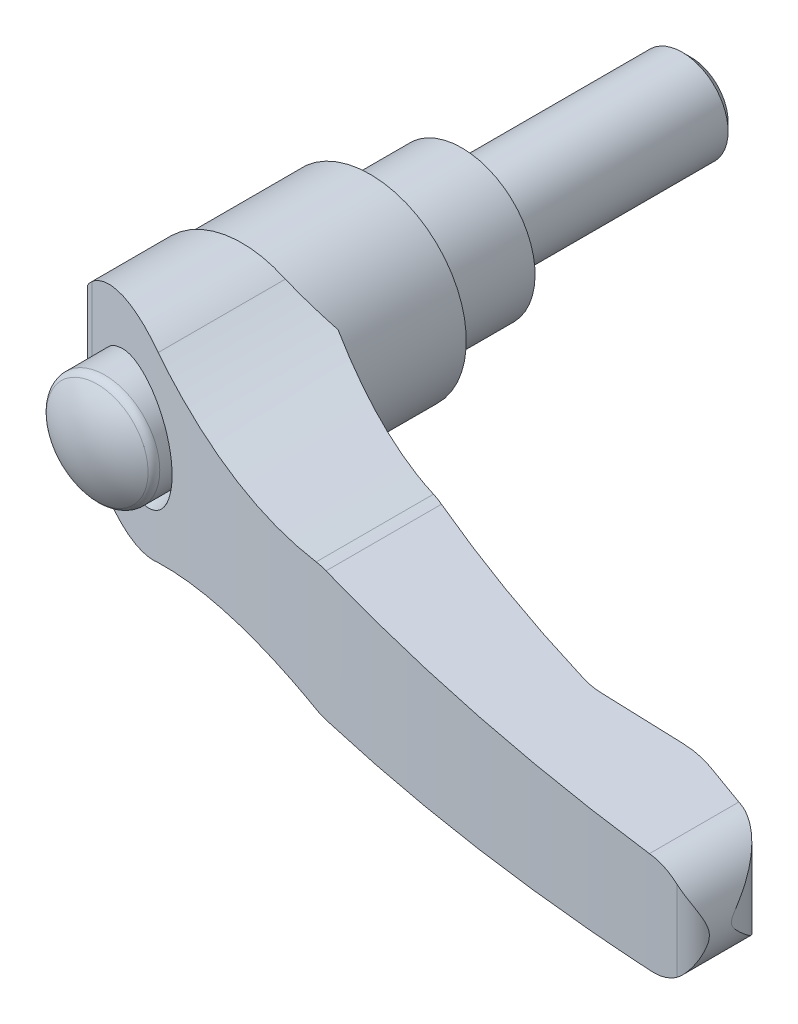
ISO-10303-21;
HEADER;
FILE_DESCRIPTION(('STEP AP214'),'2;1');
FILE_NAME('part.step','',(''),(''),'','','');
FILE_SCHEMA(('AUTOMOTIVE_DESIGN { 1 0 10303 214 1 1 1 1 }'));
ENDSEC;
DATA;
#1=APPLICATION_CONTEXT('core data for automotive mechanical design processes');
#2=APPLICATION_PROTOCOL_DEFINITION('international standard','automotive_design',2000,#1);
#3=PRODUCT_CONTEXT('',#1,'mechanical');
#4=PRODUCT('Part','Part','',(#3));
#5=PRODUCT_RELATED_PRODUCT_CATEGORY('part','',(#4));
#6=PRODUCT_DEFINITION_FORMATION('','',#4);
#7=PRODUCT_DEFINITION_CONTEXT('part definition',#1,'design');
#8=PRODUCT_DEFINITION('design','',#6,#7);
#9=PRODUCT_DEFINITION_SHAPE('','',#8);
#10=(LENGTH_UNIT() NAMED_UNIT(*) SI_UNIT(.MILLI.,.METRE.));
#11=(NAMED_UNIT(*) PLANE_ANGLE_UNIT() SI_UNIT($,.RADIAN.));
#12=(NAMED_UNIT(*) SI_UNIT($,.STERADIAN.) SOLID_ANGLE_UNIT());
#13=UNCERTAINTY_MEASURE_WITH_UNIT(LENGTH_MEASURE(1.E-05),#10,'distance_accuracy_value','');
#14=(GEOMETRIC_REPRESENTATION_CONTEXT(3) GLOBAL_UNCERTAINTY_ASSIGNED_CONTEXT((#13)) GLOBAL_UNIT_ASSIGNED_CONTEXT((#10,
#11,#12)) REPRESENTATION_CONTEXT('',''));
#15=CARTESIAN_POINT('',(0.,0.,0.));
#16=DIRECTION('',(0.,0.,1.));
#17=DIRECTION('',(1.,0.,0.));
#18=AXIS2_PLACEMENT_3D('',#15,#16,#17);
#19=CARTESIAN_POINT('',(0.,0.,-9.54));
#20=DIRECTION('',(0.,0.,-1.));
#21=DIRECTION('',(0.,1.,0.));
#22=AXIS2_PLACEMENT_3D('',#19,#20,#21);
#23=CYLINDRICAL_SURFACE('',#22,5.);
#24=CARTESIAN_POINT('',(0.,0.,0.));
#25=DIRECTION('',(0.,0.,-1.));
#26=DIRECTION('',(0.,1.,0.));
#27=AXIS2_PLACEMENT_3D('',#24,#25,#26);
#28=CIRCLE('',#27,5.);
#29=CARTESIAN_POINT('',(0.,5.,0.));
#30=VERTEX_POINT('',#29);
#31=EDGE_CURVE('E17',#30,#30,#28,.F.);
#32=ORIENTED_EDGE('',*,*,#31,.F.);
#33=EDGE_LOOP('',(#32));
#34=FACE_BOUND('',#33,.T.);
#35=CARTESIAN_POINT('',(0.,0.,-24.080000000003));
#36=DIRECTION('',(0.,0.,1.));
#37=DIRECTION('',(1.,0.,0.));
#38=AXIS2_PLACEMENT_3D('',#35,#36,#37);
#39=CIRCLE('',#38,5.);
#40=CARTESIAN_POINT('',(5.,0.,-24.080000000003));
#41=VERTEX_POINT('',#40);
#42=EDGE_CURVE('E598',#41,#41,#39,.T.);
#43=ORIENTED_EDGE('',*,*,#42,.T.);
#44=EDGE_LOOP('',(#43));
#45=FACE_BOUND('',#44,.T.);
#46=ADVANCED_FACE('F14',(#34,#45),#23,.T.);
#47=CARTESIAN_POINT('',(6.5,0.,0.));
#48=DIRECTION('',(0.,0.,-1.));
#49=DIRECTION('',(0.,1.,0.));
#50=AXIS2_PLACEMENT_3D('',#47,#48,#49);
#51=PLANE('',#50);
#52=ORIENTED_EDGE('',*,*,#31,.T.);
#53=EDGE_LOOP('',(#52));
#54=FACE_BOUND('',#53,.T.);
#55=CARTESIAN_POINT('',(0.,0.,0.));
#56=DIRECTION('',(0.,0.,-1.));
#57=DIRECTION('',(0.,1.,0.));
#58=AXIS2_PLACEMENT_3D('',#55,#56,#57);
#59=CIRCLE('',#58,8.);
#60=CARTESIAN_POINT('',(0.,8.,0.));
#61=VERTEX_POINT('',#60);
#62=EDGE_CURVE('E187',#61,#61,#59,.F.);
#63=ORIENTED_EDGE('',*,*,#62,.F.);
#64=EDGE_LOOP('',(#63));
#65=FACE_BOUND('',#64,.T.);
#66=ADVANCED_FACE('F408',(#54,#65),#51,.T.);
#67=CARTESIAN_POINT('',(0.,0.,11.15));
#68=DIRECTION('',(0.,0.,-1.));
#69=DIRECTION('',(0.,1.,0.));
#70=AXIS2_PLACEMENT_3D('',#67,#68,#69);
#71=CYLINDRICAL_SURFACE('',#70,8.);
#72=ORIENTED_EDGE('',*,*,#62,.T.);
#73=EDGE_LOOP('',(#72));
#74=FACE_BOUND('',#73,.T.);
#75=CARTESIAN_POINT('',(0.,0.,10.7));
#76=DIRECTION('',(0.,0.,-1.));
#77=DIRECTION('',(1.,0.,0.));
#78=AXIS2_PLACEMENT_3D('',#75,#76,#77);
#79=CIRCLE('',#78,8.);
#80=CARTESIAN_POINT('',(8.,0.,10.7));
#81=VERTEX_POINT('',#80);
#82=EDGE_CURVE('E185',#81,#81,#79,.T.);
#83=ORIENTED_EDGE('',*,*,#82,.T.);
#84=EDGE_LOOP('',(#83));
#85=FACE_BOUND('',#84,.T.);
#86=ADVANCED_FACE('F405',(#74,#85),#71,.T.);
#87=CARTESIAN_POINT('',(0.,0.,10.4));
#88=DIRECTION('',(0.,0.,-1.));
#89=DIRECTION('',(0.,1.,0.));
#90=AXIS2_PLACEMENT_3D('',#87,#88,#89);
#91=CONICAL_SURFACE('',#90,8.3,0.785398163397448);
#92=ORIENTED_EDGE('',*,*,#82,.F.);
#93=EDGE_LOOP('',(#92));
#94=FACE_BOUND('',#93,.T.);
#95=CARTESIAN_POINT('',(0.,0.,10.4));
#96=DIRECTION('',(0.,0.,-1.));
#97=DIRECTION('',(0.,1.,0.));
#98=AXIS2_PLACEMENT_3D('',#95,#96,#97);
#99=CIRCLE('',#98,8.3);
#100=CARTESIAN_POINT('',(0.,8.3,10.4));
#101=VERTEX_POINT('',#100);
#102=EDGE_CURVE('E177',#101,#101,#99,.T.);
#103=ORIENTED_EDGE('',*,*,#102,.T.);
#104=EDGE_LOOP('',(#103));
#105=FACE_BOUND('',#104,.T.);
#106=ADVANCED_FACE('F401',(#94,#105),#91,.F.);
#107=CARTESIAN_POINT('',(0.,0.,9.7));
#108=DIRECTION('',(0.,0.,-1.));
#109=DIRECTION('',(0.,1.,0.));
#110=AXIS2_PLACEMENT_3D('',#107,#108,#109);
#111=CYLINDRICAL_SURFACE('',#110,8.3);
#112=ORIENTED_EDGE('',*,*,#102,.F.);
#113=EDGE_LOOP('',(#112));
#114=FACE_BOUND('',#113,.T.);
#115=CARTESIAN_POINT('',(0.,0.,10.));
#116=DIRECTION('',(0.,0.,-1.));
#117=DIRECTION('',(0.,1.,0.));
#118=AXIS2_PLACEMENT_3D('',#115,#116,#117);
#119=CIRCLE('',#118,8.3);
#120=CARTESIAN_POINT('',(0.,8.3,10.));
#121=VERTEX_POINT('',#120);
#122=EDGE_CURVE('E174',#121,#121,#119,.F.);
#123=ORIENTED_EDGE('',*,*,#122,.F.);
#124=EDGE_LOOP('',(#123));
#125=FACE_BOUND('',#124,.T.);
#126=ADVANCED_FACE('F398',(#114,#125),#111,.F.);
#127=CARTESIAN_POINT('',(-5.26,0.,10.));
#128=DIRECTION('',(0.,0.,-1.));
#129=DIRECTION('',(0.,1.,0.));
#130=AXIS2_PLACEMENT_3D('',#127,#128,#129);
#131=PLANE('',#130);
#132=CARTESIAN_POINT('',(-0.00999999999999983,0.,10.));
#133=DIRECTION('',(0.,0.,1.));
#134=DIRECTION('',(-1.,0.,0.));
#135=AXIS2_PLACEMENT_3D('',#132,#133,#134);
#136=CIRCLE('',#135,10.5);
#137=CARTESIAN_POINT('',(-10.2600377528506,-2.27743848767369,10.));
#138=VERTEX_POINT('',#137);
#139=CARTESIAN_POINT('',(-10.2600377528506,2.27743848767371,10.));
#140=VERTEX_POINT('',#139);
#141=EDGE_CURVE('E166',#138,#140,#136,.T.);
#142=ORIENTED_EDGE('',*,*,#141,.F.);
#143=DIRECTION('',(0.,-1.,0.));
#144=VECTOR('',#143,1.);
#145=CARTESIAN_POINT('',(-10.2600377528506,-22.,10.));
#146=LINE('',#145,#144);
#147=EDGE_CURVE('E159',#138,#140,#146,.F.);
#148=ORIENTED_EDGE('',*,*,#147,.T.);
#149=EDGE_LOOP('',(#142,#148));
#150=FACE_BOUND('',#149,.T.);
#151=ORIENTED_EDGE('',*,*,#122,.T.);
#152=EDGE_LOOP('',(#151));
#153=FACE_BOUND('',#152,.T.);
#154=ADVANCED_FACE('F170',(#150,#153),#131,.T.);
#155=CARTESIAN_POINT('',(-10.2600377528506,-22.,10.));
#156=DIRECTION('',(0.707106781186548,0.,0.707106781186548));
#157=DIRECTION('',(-0.707106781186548,0.,0.707106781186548));
#158=AXIS2_PLACEMENT_3D('',#155,#156,#157);
#159=PLANE('',#158);
#160=ORIENTED_EDGE('',*,*,#147,.F.);
#161=CARTESIAN_POINT('',(-0.00999999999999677,0.,-0.250037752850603));
#162=DIRECTION('',(0.707106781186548,0.,0.707106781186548));
#163=DIRECTION('',(-0.707106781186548,0.,0.707106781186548));
#164=AXIS2_PLACEMENT_3D('',#161,#162,#163);
#165=ELLIPSE('',#164,14.8492424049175,10.5);
#166=EDGE_CURVE('E164',#140,#138,#165,.T.);
#167=ORIENTED_EDGE('',*,*,#166,.F.);
#168=EDGE_LOOP('',(#160,#167));
#169=FACE_BOUND('',#168,.T.);
#170=ADVANCED_FACE('F173',(#169),#159,.F.);
#171=CARTESIAN_POINT('',(-0.0100000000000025,0.,18.90625));
#172=DIRECTION('',(0.,0.,1.));
#173=DIRECTION('',(-1.,0.,0.));
#174=AXIS2_PLACEMENT_3D('',#171,#172,#173);
#175=CYLINDRICAL_SURFACE('',#174,10.5);
#176=CARTESIAN_POINT('',(-0.010000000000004,0.,24.));
#177=DIRECTION('',(0.,0.,1.));
#178=DIRECTION('',(-1.,0.,0.));
#179=AXIS2_PLACEMENT_3D('',#176,#177,#178);
#180=CIRCLE('',#179,10.5);
#181=CARTESIAN_POINT('',(-10.51,0.,24.));
#182=VERTEX_POINT('',#181);
#183=CARTESIAN_POINT('',(10.49,0.,24.));
#184=VERTEX_POINT('',#183);
#185=EDGE_CURVE('E168',#182,#184,#180,.T.);
#186=ORIENTED_EDGE('',*,*,#185,.F.);
#187=CARTESIAN_POINT('',(-0.010000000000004,0.,24.));
#188=DIRECTION('',(0.,0.,1.));
#189=DIRECTION('',(-1.,0.,0.));
#190=AXIS2_PLACEMENT_3D('',#187,#188,#189);
#191=CIRCLE('',#190,10.5);
#192=EDGE_CURVE('E361',#184,#182,#191,.T.);
#193=ORIENTED_EDGE('',*,*,#192,.F.);
#194=EDGE_LOOP('',(#186,#193));
#195=FACE_BOUND('',#194,.T.);
#196=ORIENTED_EDGE('',*,*,#141,.T.);
#197=ORIENTED_EDGE('',*,*,#166,.T.);
#198=EDGE_LOOP('',(#196,#197));
#199=FACE_BOUND('',#198,.T.);
#200=ADVANCED_FACE('F165',(#195,#199),#175,.T.);
#201=CARTESIAN_POINT('',(0.,0.,31.5));
#202=DIRECTION('',(1.,0.,0.));
#203=DIRECTION('',(0.,0.,1.));
#204=AXIS2_PLACEMENT_3D('',#201,#202,#203);
#205=SPHERICAL_SURFACE('',#204,10.);
#206=CARTESIAN_POINT('',(0.,0.,39.814794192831));
#207=DIRECTION('',(0.,0.,1.));
#208=DIRECTION('',(0.,-1.,0.));
#209=AXIS2_PLACEMENT_3D('',#206,#207,#208);
#210=CIRCLE('',#209,5.55555555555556);
#211=CARTESIAN_POINT('',(0.,-5.55555555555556,39.814794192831));
#212=VERTEX_POINT('',#211);
#213=EDGE_CURVE('E440',#212,#212,#210,.F.);
#214=ORIENTED_EDGE('',*,*,#213,.F.);
#215=EDGE_LOOP('',(#214));
#216=FACE_BOUND('',#215,.T.);
#217=ADVANCED_FACE('F386',(#216),#205,.T.);
#218=CARTESIAN_POINT('',(-10.51,-12.,24.));
#219=DIRECTION('',(0.,0.,-1.));
#220=DIRECTION('',(0.,1.,0.));
#221=AXIS2_PLACEMENT_3D('',#218,#219,#220);
#222=PLANE('',#221);
#223=ORIENTED_EDGE('',*,*,#185,.T.);
#224=DIRECTION('',(0.,-1.,0.));
#225=VECTOR('',#224,1.);
#226=CARTESIAN_POINT('',(10.4900000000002,-12.,23.9999999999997));
#227=LINE('',#226,#225);
#228=CARTESIAN_POINT('',(10.4900000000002,-8.03465812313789,24.));
#229=VERTEX_POINT('',#228);
#230=EDGE_CURVE('E368',#184,#229,#227,.T.);
#231=ORIENTED_EDGE('',*,*,#230,.T.);
#232=CARTESIAN_POINT('',(22.94,-55.53,24.));
#233=DIRECTION('',(0.,0.,1.));
#234=DIRECTION('',(0.,-1.,0.));
#235=AXIS2_PLACEMENT_3D('',#232,#233,#234);
#236=CIRCLE('',#235,49.1);
#237=CARTESIAN_POINT('',(4.72251026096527,-9.93468151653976,24.));
#238=VERTEX_POINT('',#237);
#239=EDGE_CURVE('E545',#229,#238,#236,.T.);
#240=ORIENTED_EDGE('',*,*,#239,.T.);
#241=CARTESIAN_POINT('',(0.,0.,24.));
#242=DIRECTION('',(0.,0.,1.));
#243=DIRECTION('',(0.,-1.,0.));
#244=AXIS2_PLACEMENT_3D('',#241,#242,#243);
#245=CIRCLE('',#244,11.);
#246=CARTESIAN_POINT('',(-10.51,-3.24652121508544,24.));
#247=VERTEX_POINT('',#246);
#248=EDGE_CURVE('E551',#247,#238,#245,.T.);
#249=ORIENTED_EDGE('',*,*,#248,.F.);
#250=DIRECTION('',(0.,-1.,0.));
#251=VECTOR('',#250,1.);
#252=CARTESIAN_POINT('',(-10.51,-12.,24.));
#253=LINE('',#252,#251);
#254=EDGE_CURVE('E438',#182,#247,#253,.T.);
#255=ORIENTED_EDGE('',*,*,#254,.F.);
#256=EDGE_LOOP('',(#223,#231,#240,#249,#255));
#257=FACE_BOUND('',#256,.T.);
#258=ADVANCED_FACE('F380',(#257),#222,.T.);
#259=CARTESIAN_POINT('',(31.3589689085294,0.945932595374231,54.5));
#260=DIRECTION('',(0.,0.,1.));
#261=DIRECTION('',(0.,-1.,0.));
#262=AXIS2_PLACEMENT_3D('',#259,#260,#261);
#263=CYLINDRICAL_SURFACE('',#262,8.00000000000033);
#264=CARTESIAN_POINT('',(31.6479325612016,-7.04884695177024,46.4731806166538));
#265=CARTESIAN_POINT('',(31.4018180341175,-7.05768532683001,46.4087993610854));
#266=CARTESIAN_POINT('',(31.1563854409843,-7.05525330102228,46.3442255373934));
#267=CARTESIAN_POINT('',(30.66688412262,-7.02784844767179,46.2146927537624));
#268=CARTESIAN_POINT('',(30.4228153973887,-7.00287562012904,46.1497337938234));
#269=CARTESIAN_POINT('',(30.1794286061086,-6.96663239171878,46.0845822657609));
#270=B_SPLINE_CURVE_WITH_KNOTS('',3,(#264,#265,#266,#267,#268,#269),.UNSPECIFIED.,.F.,.F.,(4,2,
4),(0.,0.76139061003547,1.52278122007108),.UNSPECIFIED.);
#271=CARTESIAN_POINT('',(31.6479325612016,-7.04884695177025,46.4731806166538));
#272=VERTEX_POINT('',#271);
#273=CARTESIAN_POINT('',(30.1794286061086,-6.96663239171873,46.084582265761));
#274=VERTEX_POINT('',#273);
#275=EDGE_CURVE('E214',#272,#274,#270,.T.);
#276=ORIENTED_EDGE('',*,*,#275,.T.);
#277=DIRECTION('',(0.,0.,1.));
#278=VECTOR('',#277,1.);
#279=CARTESIAN_POINT('',(30.1794286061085,-6.96663239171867,54.5));
#280=LINE('',#279,#278);
#281=CARTESIAN_POINT('',(30.1794286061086,-6.96663239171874,33.2732494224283));
#282=VERTEX_POINT('',#281);
#283=EDGE_CURVE('E541',#274,#282,#280,.F.);
#284=ORIENTED_EDGE('',*,*,#283,.T.);
#285=CARTESIAN_POINT('',(30.1794286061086,-6.9666323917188,33.2732494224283));
#286=CARTESIAN_POINT('',(30.4222007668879,-7.00282816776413,33.3728739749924));
#287=CARTESIAN_POINT('',(30.6665043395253,-7.02781937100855,33.4725985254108));
#288=CARTESIAN_POINT('',(31.0339219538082,-7.04840105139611,33.6217860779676));
#289=CARTESIAN_POINT('',(31.1565128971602,-7.05244559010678,33.6714318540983));
#290=CARTESIAN_POINT('',(31.4020580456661,-7.05489552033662,33.7706062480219));
#291=CARTESIAN_POINT('',(31.5250125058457,-7.05329063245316,33.8201344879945));
#292=CARTESIAN_POINT('',(31.6479325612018,-7.04884695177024,33.8695155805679));
#293=B_SPLINE_CURVE_WITH_KNOTS('',3,(#285,#286,#287,#288,#289,#290,#291,#292),.UNSPECIFIED.,.F.,
.F.,(4,2,2,4),(0.,0.794258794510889,1.19111760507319,1.58869889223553),.UNSPECIFIED.);
#294=CARTESIAN_POINT('',(31.6479325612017,-7.04884695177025,33.8695155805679));
#295=VERTEX_POINT('',#294);
#296=EDGE_CURVE('E363',#282,#295,#293,.T.);
#297=ORIENTED_EDGE('',*,*,#296,.T.);
#298=DIRECTION('',(0.,0.,1.));
#299=VECTOR('',#298,1.);
#300=CARTESIAN_POINT('',(31.6479325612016,-7.04884695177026,54.5));
#301=LINE('',#300,#299);
#302=EDGE_CURVE('E562',#295,#272,#301,.T.);
#303=ORIENTED_EDGE('',*,*,#302,.T.);
#304=EDGE_LOOP('',(#276,#284,#297,#303));
#305=FACE_BOUND('',#304,.T.);
#306=ADVANCED_FACE('F374',(#305),#263,.T.);
#307=CARTESIAN_POINT('',(79.9967051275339,-12.,50.5395921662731));
#308=DIRECTION('',(0.992331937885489,0.,-0.123601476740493));
#309=DIRECTION('',(0.123601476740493,0.,0.992331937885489));
#310=AXIS2_PLACEMENT_3D('',#307,#308,#309);
#311=PLANE('',#310);
#312=CARTESIAN_POINT('',(79.9967051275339,-0.190348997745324,50.5395921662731));
#313=CARTESIAN_POINT('',(79.996978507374,-0.182455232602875,50.5417865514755));
#314=CARTESIAN_POINT('',(79.9972360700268,-0.174525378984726,50.5438539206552));
#315=CARTESIAN_POINT('',(79.9977166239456,-0.15866415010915,50.5477110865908));
#316=CARTESIAN_POINT('',(79.9979398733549,-0.150733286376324,50.5495029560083));
#317=CARTESIAN_POINT('',(79.9983518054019,-0.134870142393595,50.5528091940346));
#318=CARTESIAN_POINT('',(79.9985407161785,-0.126938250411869,50.554325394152));
#319=CARTESIAN_POINT('',(79.9988840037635,-0.111073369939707,50.5570805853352));
#320=CARTESIAN_POINT('',(79.9990385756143,-0.103140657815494,50.5583211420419));
#321=CARTESIAN_POINT('',(79.9993132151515,-0.0872743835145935,50.5605253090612));
#322=CARTESIAN_POINT('',(79.9994334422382,-0.079341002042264,50.5614901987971));
#323=CARTESIAN_POINT('',(79.9996394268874,-0.0634736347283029,50.5631433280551));
#324=CARTESIAN_POINT('',(79.9997253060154,-0.0555397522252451,50.5638325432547));
#325=CARTESIAN_POINT('',(79.9998626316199,-0.0396716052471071,50.564934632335));
#326=CARTESIAN_POINT('',(79.9999141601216,-0.0317373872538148,50.5653481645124));
#327=CARTESIAN_POINT('',(79.9999828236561,-0.0158687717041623,50.5658992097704));
#328=CARTESIAN_POINT('',(80.,-0.00793438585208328,50.5660370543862));
#329=CARTESIAN_POINT('',(80.,0.00793438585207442,50.5660370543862));
#330=CARTESIAN_POINT('',(79.9999828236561,0.0158687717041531,50.5658992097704));
#331=CARTESIAN_POINT('',(79.9999141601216,0.0317373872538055,50.5653481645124));
#332=CARTESIAN_POINT('',(79.9998626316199,0.0396716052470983,50.564934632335));
#333=CARTESIAN_POINT('',(79.9997253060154,0.0555397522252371,50.5638325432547));
#334=CARTESIAN_POINT('',(79.9996394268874,0.0634736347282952,50.5631433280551));
#335=CARTESIAN_POINT('',(79.9994334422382,0.0793410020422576,50.5614901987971));
#336=CARTESIAN_POINT('',(79.9993132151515,0.0872743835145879,50.5605253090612));
#337=CARTESIAN_POINT('',(79.9990385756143,0.10314065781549,50.5583211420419));
#338=CARTESIAN_POINT('',(79.9988840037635,0.111073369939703,50.5570805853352));
#339=CARTESIAN_POINT('',(79.9985407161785,0.126938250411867,50.554325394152));
#340=CARTESIAN_POINT('',(79.9983518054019,0.134870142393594,50.5528091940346));
#341=CARTESIAN_POINT('',(79.9979398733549,0.150733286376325,50.5495029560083));
#342=CARTESIAN_POINT('',(79.9977166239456,0.158664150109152,50.5477110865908));
#343=CARTESIAN_POINT('',(79.9972360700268,0.17452537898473,50.5438539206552));
#344=CARTESIAN_POINT('',(79.996978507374,0.182455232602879,50.5417865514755));
#345=CARTESIAN_POINT('',(79.9967051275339,0.190348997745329,50.5395921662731));
#346=B_SPLINE_CURVE_WITH_KNOTS('',3,(#312,#313,#314,#315,#316,#317,#318,#319,#320,#321,#322,
#323,#324,#325,#326,#327,#328,#329,#330,#331,#332,#333,#334,#335,#336,#337,#338,#339,#340,#341,
#342,#343,#344,#345),.UNSPECIFIED.,.F.,.F.,(4,2,2,2,2,2,2,2,2,2,2,2,2,2,2,2,4),(0.,
0.0245922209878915,0.0489892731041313,0.0732177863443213,0.0973049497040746,0.121278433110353,
0.145166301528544,0.168996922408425,0.192798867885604,0.216600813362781,0.240431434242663,
0.264319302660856,0.288292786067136,0.312379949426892,0.336608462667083,0.361005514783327,
0.385597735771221),.UNSPECIFIED.);
#347=CARTESIAN_POINT('',(79.9967051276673,-0.190348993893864,50.5395921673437));
#348=VERTEX_POINT('',#347);
#349=CARTESIAN_POINT('',(79.9967051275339,0.190348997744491,50.5395921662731));
#350=VERTEX_POINT('',#349);
#351=EDGE_CURVE('E568',#348,#350,#346,.T.);
#352=ORIENTED_EDGE('',*,*,#351,.F.);
#353=DIRECTION('',(0.,-1.,0.));
#354=VECTOR('',#353,1.);
#355=CARTESIAN_POINT('',(79.9967051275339,-12.,50.5395921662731));
#356=LINE('',#355,#354);
#357=EDGE_CURVE('E425',#350,#348,#356,.T.);
#358=ORIENTED_EDGE('',*,*,#357,.F.);
#359=EDGE_LOOP('',(#352,#358));
#360=FACE_BOUND('',#359,.T.);
#361=ADVANCED_FACE('F379',(#360),#311,.T.);
#362=CARTESIAN_POINT('',(72.6137555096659,-12.,51.4591871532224));
#363=DIRECTION('',(0.,-1.,0.));
#364=DIRECTION('',(1.,0.,0.));
#365=AXIS2_PLACEMENT_3D('',#362,#363,#364);
#366=CYLINDRICAL_SURFACE('',#365,7.44);
#367=CARTESIAN_POINT('',(79.9967051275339,0.190348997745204,50.5395921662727));
#368=CARTESIAN_POINT('',(79.9951469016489,0.235214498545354,50.5270575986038));
#369=CARTESIAN_POINT('',(79.9930953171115,0.278736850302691,50.5108629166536));
#370=CARTESIAN_POINT('',(79.988164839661,0.363077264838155,50.4732708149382));
#371=CARTESIAN_POINT('',(79.9852922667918,0.403913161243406,50.4519133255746));
#372=CARTESIAN_POINT('',(79.975702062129,0.522458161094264,50.3833482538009));
#373=CARTESIAN_POINT('',(79.9679715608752,0.597169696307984,50.3312876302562));
#374=CARTESIAN_POINT('',(79.9508869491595,0.736456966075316,50.2251559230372));
#375=CARTESIAN_POINT('',(79.9416856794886,0.801375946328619,50.1714851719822));
#376=CARTESIAN_POINT('',(79.9214540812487,0.928420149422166,50.0612288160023));
#377=CARTESIAN_POINT('',(79.9104232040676,0.990544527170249,50.0046423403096));
#378=CARTESIAN_POINT('',(79.8746515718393,1.17419942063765,49.8323129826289));
#379=CARTESIAN_POINT('',(79.8472488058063,1.29287988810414,49.7141099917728));
#380=CARTESIAN_POINT('',(79.7848398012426,1.52823594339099,49.4729704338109));
#381=CARTESIAN_POINT('',(79.7496926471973,1.64482416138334,49.3499864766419));
#382=CARTESIAN_POINT('',(79.6721004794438,1.87458318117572,49.1033284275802));
#383=CARTESIAN_POINT('',(79.6296610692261,1.98775652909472,48.9796549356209));
#384=CARTESIAN_POINT('',(79.5033816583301,2.29352791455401,48.6415502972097));
#385=CARTESIAN_POINT('',(79.4120558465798,2.48329449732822,48.427296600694));
#386=CARTESIAN_POINT('',(79.2061355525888,2.85434488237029,48.0023120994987));
#387=CARTESIAN_POINT('',(79.0915236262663,3.03562219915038,47.7915840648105));
#388=CARTESIAN_POINT('',(78.8390032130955,3.38665877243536,47.3777391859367));
#389=CARTESIAN_POINT('',(78.7012752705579,3.55649399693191,47.1745772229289));
#390=CARTESIAN_POINT('',(78.4009143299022,3.8835680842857,46.7768350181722));
#391=CARTESIAN_POINT('',(78.2383021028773,4.04081728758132,46.5822477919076));
#392=CARTESIAN_POINT('',(77.9568022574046,4.2801698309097,46.2794503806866));
#393=CARTESIAN_POINT('',(77.8461272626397,4.36735584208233,46.1675710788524));
#394=CARTESIAN_POINT('',(77.61512986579,4.53501217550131,45.9487274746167));
#395=CARTESIAN_POINT('',(77.494805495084,4.61548112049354,45.8417641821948));
#396=CARTESIAN_POINT('',(77.2447591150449,4.7684092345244,45.6339165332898));
#397=CARTESIAN_POINT('',(77.1150589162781,4.84088606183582,45.5330190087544));
#398=CARTESIAN_POINT('',(76.8461728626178,4.97676025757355,45.3380932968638));
#399=CARTESIAN_POINT('',(76.7069926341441,5.04016294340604,45.2440611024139));
#400=CARTESIAN_POINT('',(76.4438690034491,5.14664435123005,45.0792448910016));
#401=CARTESIAN_POINT('',(76.3213555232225,5.19134589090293,45.0072256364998));
#402=CARTESIAN_POINT('',(76.0703754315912,5.27269544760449,44.8693561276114));
#403=CARTESIAN_POINT('',(75.9419112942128,5.30934677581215,44.8035033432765));
#404=CARTESIAN_POINT('',(75.678496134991,5.37397975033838,44.6781572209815));
#405=CARTESIAN_POINT('',(75.5435027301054,5.40189236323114,44.6187168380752));
#406=CARTESIAN_POINT('',(75.2686009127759,5.44782102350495,44.507386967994));
#407=CARTESIAN_POINT('',(75.1286862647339,5.46582399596,44.4555075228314));
#408=CARTESIAN_POINT('',(74.9868127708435,5.47841339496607,44.407790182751));
#409=B_SPLINE_CURVE_WITH_KNOTS('',3,(#367,#368,#369,#370,#371,#372,#373,#374,#375,#376,#377,
#378,#379,#380,#381,#382,#383,#384,#385,#386,#387,#388,#389,#390,#391,#392,#393,#394,#395,#396,
#397,#398,#399,#400,#401,#402,#403,#404,#405,#406,#407,#408),.UNSPECIFIED.,.F.,.F.,(4,2,2,2,2,2,
2,2,2,2,2,2,2,2,2,2,2,2,2,2,4),(0.,0.139245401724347,0.277446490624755,0.550810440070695,
0.80490688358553,1.05907965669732,1.56794086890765,2.08696422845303,2.60559053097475,
3.50582150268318,4.40672935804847,5.30090298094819,6.1943342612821,6.7336794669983,
7.27313498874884,7.81137365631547,8.3492956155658,8.79580649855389,9.2421333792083,
9.69190199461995,10.1422626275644),.UNSPECIFIED.);
#410=CARTESIAN_POINT('',(74.9868127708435,5.47841339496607,44.407790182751));
#411=VERTEX_POINT('',#410);
#412=EDGE_CURVE('E572',#350,#411,#409,.T.);
#413=ORIENTED_EDGE('',*,*,#412,.F.);
#414=ORIENTED_EDGE('',*,*,#357,.T.);
#415=CARTESIAN_POINT('',(74.9868127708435,-5.47841339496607,44.407790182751));
#416=CARTESIAN_POINT('',(75.1398120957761,-5.46484028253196,44.459242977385));
#417=CARTESIAN_POINT('',(75.2905169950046,-5.44496899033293,44.5155387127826));
#418=CARTESIAN_POINT('',(75.5860882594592,-5.39377415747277,44.6368581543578));
#419=CARTESIAN_POINT('',(75.7309637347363,-5.36246932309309,44.7018674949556));
#420=CARTESIAN_POINT('',(76.0125967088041,-5.28989557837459,44.8390817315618));
#421=CARTESIAN_POINT('',(76.1494251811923,-5.24873835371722,44.9112009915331));
#422=CARTESIAN_POINT('',(76.4161065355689,-5.15736483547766,45.0623731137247));
#423=CARTESIAN_POINT('',(76.5459558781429,-5.10714400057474,45.1414294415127));
#424=CARTESIAN_POINT('',(76.8276536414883,-4.98604991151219,45.3247681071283));
#425=CARTESIAN_POINT('',(76.9775772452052,-4.91309116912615,45.4306358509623));
#426=CARTESIAN_POINT('',(77.265789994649,-4.75681575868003,45.6501400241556));
#427=CARTESIAN_POINT('',(77.4040776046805,-4.67349772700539,45.7637774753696));
#428=CARTESIAN_POINT('',(77.8028296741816,-4.40945601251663,46.1156758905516));
#429=CARTESIAN_POINT('',(78.0457801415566,-4.21527563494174,46.3639882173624));
#430=CARTESIAN_POINT('',(78.417694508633,-3.86589184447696,46.7984433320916));
#431=CARTESIAN_POINT('',(78.5586476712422,-3.71726415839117,46.9799982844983));
#432=CARTESIAN_POINT('',(78.8199419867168,-3.41009407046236,47.3496806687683));
#433=CARTESIAN_POINT('',(78.940273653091,-3.25154715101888,47.537811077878));
#434=CARTESIAN_POINT('',(79.1607378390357,-2.92676895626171,47.9181651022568));
#435=CARTESIAN_POINT('',(79.2609186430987,-2.76055725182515,48.1103776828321));
#436=CARTESIAN_POINT('',(79.4421677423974,-2.42115236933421,48.4974286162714));
#437=CARTESIAN_POINT('',(79.5232445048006,-2.24796232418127,48.692265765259));
#438=CARTESIAN_POINT('',(79.6578968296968,-1.91676087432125,49.0578102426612));
#439=CARTESIAN_POINT('',(79.7136489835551,-1.75958096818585,49.2284695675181));
#440=CARTESIAN_POINT('',(79.786963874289,-1.51825146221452,49.4826945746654));
#441=CARTESIAN_POINT('',(79.8097141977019,-1.43673320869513,49.567289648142));
#442=CARTESIAN_POINT('',(79.8517302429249,-1.27132927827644,49.7350141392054));
#443=CARTESIAN_POINT('',(79.870996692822,-1.18744410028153,49.8181438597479));
#444=CARTESIAN_POINT('',(79.9071865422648,-1.01046435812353,49.9869732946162));
#445=CARTESIAN_POINT('',(79.9238666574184,-0.917129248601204,50.0724723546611));
#446=CARTESIAN_POINT('',(79.9529450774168,-0.724505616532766,50.2358460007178));
#447=CARTESIAN_POINT('',(79.9653823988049,-0.625281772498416,50.3137850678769));
#448=CARTESIAN_POINT('',(79.9802376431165,-0.468580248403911,50.4153149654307));
#449=CARTESIAN_POINT('',(79.9845030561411,-0.416215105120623,50.4460963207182));
#450=CARTESIAN_POINT('',(79.9917045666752,-0.30687937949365,50.4998809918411));
#451=CARTESIAN_POINT('',(79.9946243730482,-0.249861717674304,50.5227881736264));
#452=CARTESIAN_POINT('',(79.9967051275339,-0.190348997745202,50.5395921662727));
#453=B_SPLINE_CURVE_WITH_KNOTS('',3,(#415,#416,#417,#418,#419,#420,#421,#422,#423,#424,#425,
#426,#427,#428,#429,#430,#431,#432,#433,#434,#435,#436,#437,#438,#439,#440,#441,#442,#443,#444,
#445,#446,#447,#448,#449,#450,#451,#452),.UNSPECIFIED.,.F.,.F.,(4,2,2,2,2,2,2,2,2,2,2,2,2,2,2,2,
2,2,4),(0.,0.485611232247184,0.970431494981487,1.44999646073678,1.92980238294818,
2.52141817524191,3.11311192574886,4.30183389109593,5.12208341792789,5.94270927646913,
6.76134473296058,7.57961667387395,8.29494630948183,8.65387747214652,9.01273353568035,
9.39561932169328,9.77488268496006,9.95698827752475,10.141244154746),.UNSPECIFIED.);
#454=CARTESIAN_POINT('',(74.9868127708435,-5.47841339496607,44.407790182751));
#455=VERTEX_POINT('',#454);
#456=EDGE_CURVE('E573',#455,#348,#453,.T.);
#457=ORIENTED_EDGE('',*,*,#456,.F.);
#458=DIRECTION('',(0.,-1.,0.));
#459=VECTOR('',#458,1.);
#460=CARTESIAN_POINT('',(74.9868127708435,-12.,44.407790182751));
#461=LINE('',#460,#459);
#462=EDGE_CURVE('E457',#411,#455,#461,.T.);
#463=ORIENTED_EDGE('',*,*,#462,.F.);
#464=EDGE_LOOP('',(#413,#414,#457,#463));
#465=FACE_BOUND('',#464,.T.);
#466=ADVANCED_FACE('F721',(#465),#366,.T.);
#467=CARTESIAN_POINT('',(57.3760512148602,-12.,33.47));
#468=DIRECTION('',(0.,-1.,0.));
#469=DIRECTION('',(1.,0.,0.));
#470=AXIS2_PLACEMENT_3D('',#467,#468,#469);
#471=CYLINDRICAL_SURFACE('',#470,8.58999999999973);
#472=DIRECTION('',(0.,-1.,0.));
#473=VECTOR('',#472,1.);
#474=CARTESIAN_POINT('',(55.1138126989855,-12.,41.756759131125));
#475=LINE('',#474,#473);
#476=CARTESIAN_POINT('',(55.1138126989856,-6.20069518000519,41.7567591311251));
#477=VERTEX_POINT('',#476);
#478=CARTESIAN_POINT('',(55.1138126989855,6.2006951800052,41.7567591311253));
#479=VERTEX_POINT('',#478);
#480=EDGE_CURVE('E360',#477,#479,#475,.F.);
#481=ORIENTED_EDGE('',*,*,#480,.T.);
#482=CARTESIAN_POINT('',(57.3760512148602,6.11892873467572,33.47));
#483=DIRECTION('',(-0.0361204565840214,-0.999347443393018,0.));
#484=DIRECTION('',(0.999347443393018,-0.0361204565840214,0.));
#485=AXIS2_PLACEMENT_3D('',#482,#483,#484);
#486=ELLIPSE('',#485,8.59560912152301,8.58999999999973);
#487=CARTESIAN_POINT('',(57.3760512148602,6.11892873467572,42.06));
#488=VERTEX_POINT('',#487);
#489=EDGE_CURVE('E482',#479,#488,#486,.F.);
#490=ORIENTED_EDGE('',*,*,#489,.T.);
#491=DIRECTION('',(0.,1.,0.));
#492=VECTOR('',#491,1.);
#493=CARTESIAN_POINT('',(57.3760512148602,-12.,42.06));
#494=LINE('',#493,#492);
#495=CARTESIAN_POINT('',(57.3760512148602,-6.11892873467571,42.06));
#496=VERTEX_POINT('',#495);
#497=EDGE_CURVE('E428',#496,#488,#494,.T.);
#498=ORIENTED_EDGE('',*,*,#497,.F.);
#499=CARTESIAN_POINT('',(57.3760512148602,-6.11892873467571,33.47));
#500=DIRECTION('',(-0.0361204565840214,0.999347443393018,0.));
#501=DIRECTION('',(-0.999347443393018,-0.0361204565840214,0.));
#502=AXIS2_PLACEMENT_3D('',#499,#500,#501);
#503=ELLIPSE('',#502,8.59560912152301,8.58999999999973);
#504=EDGE_CURVE('E565',#496,#477,#503,.F.);
#505=ORIENTED_EDGE('',*,*,#504,.T.);
#506=EDGE_LOOP('',(#481,#490,#498,#505));
#507=FACE_BOUND('',#506,.T.);
#508=ADVANCED_FACE('F713',(#507),#471,.F.);
#509=CARTESIAN_POINT('',(57.3760512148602,-12.,42.06));
#510=DIRECTION('',(0.,0.,-1.));
#511=DIRECTION('',(0.,1.,0.));
#512=AXIS2_PLACEMENT_3D('',#509,#510,#511);
#513=PLANE('',#512);
#514=DIRECTION('',(0.999347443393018,-0.0361204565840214,0.));
#515=VECTOR('',#514,1.);
#516=CARTESIAN_POINT('',(31.6479325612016,7.04884695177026,42.06));
#517=LINE('',#516,#515);
#518=CARTESIAN_POINT('',(66.1633245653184,5.80132115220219,42.06));
#519=VERTEX_POINT('',#518);
#520=EDGE_CURVE('E476',#488,#519,#517,.T.);
#521=ORIENTED_EDGE('',*,*,#520,.T.);
#522=DIRECTION('',(0.,-1.,0.));
#523=VECTOR('',#522,1.);
#524=CARTESIAN_POINT('',(66.1633245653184,-12.,42.06));
#525=LINE('',#524,#523);
#526=CARTESIAN_POINT('',(66.1633245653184,-5.80132115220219,42.06));
#527=VERTEX_POINT('',#526);
#528=EDGE_CURVE('E435',#527,#519,#525,.F.);
#529=ORIENTED_EDGE('',*,*,#528,.F.);
#530=DIRECTION('',(-0.999347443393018,-0.0361204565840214,0.));
#531=VECTOR('',#530,1.);
#532=CARTESIAN_POINT('',(74.5,-5.5,42.06));
#533=LINE('',#532,#531);
#534=EDGE_CURVE('E548',#527,#496,#533,.T.);
#535=ORIENTED_EDGE('',*,*,#534,.T.);
#536=ORIENTED_EDGE('',*,*,#497,.T.);
#537=EDGE_LOOP('',(#521,#529,#535,#536));
#538=FACE_BOUND('',#537,.T.);
#539=ADVANCED_FACE('F705',(#538),#513,.T.);
#540=CARTESIAN_POINT('',(66.1633245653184,-12.,53.34));
#541=DIRECTION('',(0.,-1.,0.));
#542=DIRECTION('',(1.,0.,0.));
#543=AXIS2_PLACEMENT_3D('',#540,#541,#542);
#544=CYLINDRICAL_SURFACE('',#543,11.2800000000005);
#545=CARTESIAN_POINT('',(66.1633245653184,5.80132115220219,53.34));
#546=DIRECTION('',(-0.0361204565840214,-0.999347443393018,0.));
#547=DIRECTION('',(0.999347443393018,-0.0361204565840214,0.));
#548=AXIS2_PLACEMENT_3D('',#545,#546,#547);
#549=ELLIPSE('',#548,11.2873656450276,11.2800000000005);
#550=CARTESIAN_POINT('',(69.7611855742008,5.6712799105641,42.6491723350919));
#551=VERTEX_POINT('',#550);
#552=EDGE_CURVE('E466',#519,#551,#549,.T.);
#553=ORIENTED_EDGE('',*,*,#552,.T.);
#554=DIRECTION('',(0.,-1.,0.));
#555=VECTOR('',#554,1.);
#556=CARTESIAN_POINT('',(69.7611855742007,-12.,42.6491723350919));
#557=LINE('',#556,#555);
#558=CARTESIAN_POINT('',(69.7611855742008,-5.6712799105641,42.6491723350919));
#559=VERTEX_POINT('',#558);
#560=EDGE_CURVE('E459',#559,#551,#557,.F.);
#561=ORIENTED_EDGE('',*,*,#560,.F.);
#562=CARTESIAN_POINT('',(66.1633245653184,-5.80132115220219,53.34));
#563=DIRECTION('',(-0.0361204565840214,0.999347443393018,0.));
#564=DIRECTION('',(-0.999347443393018,-0.0361204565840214,0.));
#565=AXIS2_PLACEMENT_3D('',#562,#563,#564);
#566=ELLIPSE('',#565,11.2873656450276,11.2800000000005);
#567=EDGE_CURVE('E468',#559,#527,#566,.T.);
#568=ORIENTED_EDGE('',*,*,#567,.T.);
#569=ORIENTED_EDGE('',*,*,#528,.T.);
#570=EDGE_LOOP('',(#553,#561,#568,#569));
#571=FACE_BOUND('',#570,.T.);
#572=ADVANCED_FACE('F465',(#571),#544,.T.);
#573=CARTESIAN_POINT('',(69.7611855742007,-12.,42.6491723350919));
#574=DIRECTION('',(0.318959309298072,0.,-0.947768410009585));
#575=DIRECTION('',(0.947768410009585,0.,0.318959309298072));
#576=AXIS2_PLACEMENT_3D('',#573,#574,#575);
#577=PLANE('',#576);
#578=ORIENTED_EDGE('',*,*,#462,.T.);
#579=CARTESIAN_POINT('',(74.5,0.,44.2439595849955));
#580=DIRECTION('',(0.318959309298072,0.,-0.947768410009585));
#581=DIRECTION('',(0.947768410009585,0.,0.318959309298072));
#582=AXIS2_PLACEMENT_3D('',#579,#580,#581);
#583=ELLIPSE('',#582,5.80310542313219,5.5);
#584=CARTESIAN_POINT('',(74.5,-5.5,44.2439595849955));
#585=VERTEX_POINT('',#584);
#586=EDGE_CURVE('E563',#585,#455,#583,.F.);
#587=ORIENTED_EDGE('',*,*,#586,.F.);
#588=DIRECTION('',(-0.947212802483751,-0.0342360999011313,-0.318772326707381));
#589=VECTOR('',#588,1.);
#590=CARTESIAN_POINT('',(74.5,-5.5,44.2439595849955));
#591=LINE('',#590,#589);
#592=EDGE_CURVE('E521',#585,#559,#591,.T.);
#593=ORIENTED_EDGE('',*,*,#592,.T.);
#594=ORIENTED_EDGE('',*,*,#560,.T.);
#595=DIRECTION('',(0.947212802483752,-0.0342360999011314,0.31877232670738));
#596=VECTOR('',#595,1.);
#597=CARTESIAN_POINT('',(69.7611855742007,5.6712799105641,42.6491723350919));
#598=LINE('',#597,#596);
#599=CARTESIAN_POINT('',(74.5,5.5,44.2439595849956));
#600=VERTEX_POINT('',#599);
#601=EDGE_CURVE('E479',#551,#600,#598,.T.);
#602=ORIENTED_EDGE('',*,*,#601,.T.);
#603=CARTESIAN_POINT('',(74.5,0.,44.2439595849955));
#604=DIRECTION('',(0.318959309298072,0.,-0.947768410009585));
#605=DIRECTION('',(0.947768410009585,0.,0.318959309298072));
#606=AXIS2_PLACEMENT_3D('',#603,#604,#605);
#607=ELLIPSE('',#606,5.80310542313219,5.5);
#608=EDGE_CURVE('E498',#411,#600,#607,.F.);
#609=ORIENTED_EDGE('',*,*,#608,.F.);
#610=EDGE_LOOP('',(#578,#587,#593,#594,#602,#609));
#611=FACE_BOUND('',#610,.T.);
#612=ADVANCED_FACE('F690',(#611),#577,.T.);
#613=CARTESIAN_POINT('',(31.3589689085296,-0.945932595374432,54.5));
#614=DIRECTION('',(0.,0.,1.));
#615=DIRECTION('',(0.,-1.,0.));
#616=AXIS2_PLACEMENT_3D('',#613,#614,#615);
#617=CYLINDRICAL_SURFACE('',#616,8.00000000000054);
#618=CARTESIAN_POINT('',(30.1794286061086,6.96663239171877,46.0845822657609));
#619=CARTESIAN_POINT('',(30.4228153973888,7.00287562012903,46.1497337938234));
#620=CARTESIAN_POINT('',(30.66688412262,7.02784844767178,46.2146927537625));
#621=CARTESIAN_POINT('',(31.1563854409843,7.05525330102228,46.3442255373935));
#622=CARTESIAN_POINT('',(31.4018180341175,7.05768532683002,46.4087993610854));
#623=CARTESIAN_POINT('',(31.6479325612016,7.04884695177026,46.4731806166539));
#624=B_SPLINE_CURVE_WITH_KNOTS('',3,(#618,#619,#620,#621,#622,#623),.UNSPECIFIED.,.F.,.F.,(4,2,
4),(0.,0.761390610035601,1.52278122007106),.UNSPECIFIED.);
#625=CARTESIAN_POINT('',(30.1794286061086,6.96663239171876,46.0845822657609));
#626=VERTEX_POINT('',#625);
#627=CARTESIAN_POINT('',(31.6479325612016,7.04884695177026,46.4731806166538));
#628=VERTEX_POINT('',#627);
#629=EDGE_CURVE('E369',#626,#628,#624,.T.);
#630=ORIENTED_EDGE('',*,*,#629,.T.);
#631=DIRECTION('',(0.,0.,1.));
#632=VECTOR('',#631,1.);
#633=CARTESIAN_POINT('',(31.6479325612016,7.04884695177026,54.5));
#634=LINE('',#633,#632);
#635=CARTESIAN_POINT('',(31.6479325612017,7.04884695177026,33.8695155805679));
#636=VERTEX_POINT('',#635);
#637=EDGE_CURVE('E489',#628,#636,#634,.F.);
#638=ORIENTED_EDGE('',*,*,#637,.T.);
#639=CARTESIAN_POINT('',(31.6479325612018,7.04884695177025,33.8695155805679));
#640=CARTESIAN_POINT('',(31.5250125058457,7.05329063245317,33.8201344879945));
#641=CARTESIAN_POINT('',(31.4020580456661,7.05489552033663,33.7706062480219));
#642=CARTESIAN_POINT('',(31.1565128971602,7.05244559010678,33.6714318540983));
#643=CARTESIAN_POINT('',(31.0339219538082,7.04840105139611,33.6217860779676));
#644=CARTESIAN_POINT('',(30.6665043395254,7.02781937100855,33.4725985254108));
#645=CARTESIAN_POINT('',(30.4222007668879,7.00282816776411,33.3728739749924));
#646=CARTESIAN_POINT('',(30.1794286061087,6.96663239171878,33.2732494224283));
#647=B_SPLINE_CURVE_WITH_KNOTS('',3,(#639,#640,#641,#642,#643,#644,#645,#646),.UNSPECIFIED.,.F.,
.F.,(4,2,2,4),(0.,0.39758128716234,0.794440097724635,1.58869889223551),.UNSPECIFIED.);
#648=CARTESIAN_POINT('',(30.1794286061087,6.96663239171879,33.2732494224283));
#649=VERTEX_POINT('',#648);
#650=EDGE_CURVE('E353',#636,#649,#647,.T.);
#651=ORIENTED_EDGE('',*,*,#650,.T.);
#652=DIRECTION('',(0.,0.,1.));
#653=VECTOR('',#652,1.);
#654=CARTESIAN_POINT('',(30.1794286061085,6.96663239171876,54.5));
#655=LINE('',#654,#653);
#656=EDGE_CURVE('E480',#649,#626,#655,.T.);
#657=ORIENTED_EDGE('',*,*,#656,.T.);
#658=EDGE_LOOP('',(#630,#638,#651,#657));
#659=FACE_BOUND('',#658,.T.);
#660=ADVANCED_FACE('F336',(#659),#617,.T.);
#661=CARTESIAN_POINT('',(111.590768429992,-12.,-165.122809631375));
#662=DIRECTION('',(0.,-1.,0.));
#663=DIRECTION('',(1.,0.,0.));
#664=AXIS2_PLACEMENT_3D('',#661,#662,#663);
#665=CYLINDRICAL_SURFACE('',#664,214.45);
#666=ORIENTED_EDGE('',*,*,#650,.F.);
#667=CARTESIAN_POINT('',(111.590768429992,4.15938968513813,-165.122809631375));
#668=DIRECTION('',(-0.0361204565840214,-0.999347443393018,0.));
#669=DIRECTION('',(0.999347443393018,-0.0361204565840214,0.));
#670=AXIS2_PLACEMENT_3D('',#667,#668,#669);
#671=ELLIPSE('',#670,214.590032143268,214.45);
#672=EDGE_CURVE('E486',#636,#479,#671,.F.);
#673=ORIENTED_EDGE('',*,*,#672,.T.);
#674=ORIENTED_EDGE('',*,*,#480,.F.);
#675=CARTESIAN_POINT('',(111.590768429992,-4.15938968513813,-165.122809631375));
#676=DIRECTION('',(-0.0361204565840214,0.999347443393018,0.));
#677=DIRECTION('',(-0.999347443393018,-0.0361204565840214,0.));
#678=AXIS2_PLACEMENT_3D('',#675,#676,#677);
#679=ELLIPSE('',#678,214.590032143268,214.45);
#680=EDGE_CURVE('E561',#477,#295,#679,.F.);
#681=ORIENTED_EDGE('',*,*,#680,.T.);
#682=ORIENTED_EDGE('',*,*,#296,.F.);
#683=CARTESIAN_POINT('',(30.1794286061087,-6.9666323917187,33.2732494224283));
#684=CARTESIAN_POINT('',(29.3385114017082,-6.84126069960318,32.9282027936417));
#685=CARTESIAN_POINT('',(28.4970001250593,-6.73815583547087,32.5766232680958));
#686=CARTESIAN_POINT('',(26.8150445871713,-6.57586454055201,31.8612301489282));
#687=CARTESIAN_POINT('',(25.9746002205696,-6.51667337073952,31.4974178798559));
#688=CARTESIAN_POINT('',(24.3042391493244,-6.44189817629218,30.7615707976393));
#689=CARTESIAN_POINT('',(23.4742949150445,-6.42593469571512,30.3896366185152));
#690=CARTESIAN_POINT('',(21.8194069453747,-6.43581555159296,29.6353273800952));
#691=CARTESIAN_POINT('',(20.994463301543,-6.46166065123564,29.2529521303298));
#692=CARTESIAN_POINT('',(19.3515465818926,-6.55439535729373,28.4787218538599));
#693=CARTESIAN_POINT('',(18.5335723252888,-6.62127786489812,28.0868684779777));
#694=CARTESIAN_POINT('',(16.9061160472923,-6.79528972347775,27.2945449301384));
#695=CARTESIAN_POINT('',(16.0966341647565,-6.90241973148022,26.8940746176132));
#696=CARTESIAN_POINT('',(14.4805646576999,-7.15724867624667,26.0818856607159));
#697=CARTESIAN_POINT('',(13.6740672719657,-7.305300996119,25.6700985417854));
#698=CARTESIAN_POINT('',(12.0728488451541,-7.64070973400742,24.8398212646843));
#699=CARTESIAN_POINT('',(11.2781269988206,-7.82806345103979,24.4213315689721));
#700=CARTESIAN_POINT('',(10.4900000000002,-8.03465812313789,23.9999999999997));
#701=B_SPLINE_CURVE_WITH_KNOTS('',3,(#683,#684,#685,#686,#687,#688,#689,#690,#691,#692,#693,
#694,#695,#696,#697,#698,#699,#700),.UNSPECIFIED.,.F.,.F.,(4,2,2,2,2,2,2,2,4),(0.,
2.75232880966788,5.50436055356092,8.23215522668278,10.9599996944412,13.6873724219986,
16.4147896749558,19.1665377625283,21.9180967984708),.UNSPECIFIED.);
#702=EDGE_CURVE('E343',#282,#229,#701,.T.);
#703=ORIENTED_EDGE('',*,*,#702,.T.);
#704=ORIENTED_EDGE('',*,*,#230,.F.);
#705=DIRECTION('',(0.,1.,0.));
#706=VECTOR('',#705,1.);
#707=CARTESIAN_POINT('',(10.49,-12.,24.));
#708=LINE('',#707,#706);
#709=CARTESIAN_POINT('',(10.49,8.03465812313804,24.));
#710=VERTEX_POINT('',#709);
#711=EDGE_CURVE('E359',#710,#184,#708,.F.);
#712=ORIENTED_EDGE('',*,*,#711,.F.);
#713=CARTESIAN_POINT('',(10.4900000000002,8.03465812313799,23.9999999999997));
#714=CARTESIAN_POINT('',(11.2781269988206,7.82806345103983,24.4213315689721));
#715=CARTESIAN_POINT('',(12.0728488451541,7.64070973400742,24.8398212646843));
#716=CARTESIAN_POINT('',(13.6740672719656,7.30530099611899,25.6700985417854));
#717=CARTESIAN_POINT('',(14.4805646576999,7.15724867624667,26.0818856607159));
#718=CARTESIAN_POINT('',(16.0966341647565,6.90241973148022,26.8940746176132));
#719=CARTESIAN_POINT('',(16.9061160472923,6.79528972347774,27.2945449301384));
#720=CARTESIAN_POINT('',(18.5335723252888,6.62127786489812,28.0868684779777));
#721=CARTESIAN_POINT('',(19.3515465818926,6.55439535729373,28.4787218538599));
#722=CARTESIAN_POINT('',(20.994463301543,6.46166065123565,29.2529521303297));
#723=CARTESIAN_POINT('',(21.8194069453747,6.43581555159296,29.6353273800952));
#724=CARTESIAN_POINT('',(23.4742949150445,6.42593469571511,30.3896366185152));
#725=CARTESIAN_POINT('',(24.3042391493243,6.44189817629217,30.7615707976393));
#726=CARTESIAN_POINT('',(25.9746002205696,6.51667337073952,31.4974178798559));
#727=CARTESIAN_POINT('',(26.8150445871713,6.575864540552,31.8612301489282));
#728=CARTESIAN_POINT('',(28.4970001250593,6.73815583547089,32.5766232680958));
#729=CARTESIAN_POINT('',(29.3385114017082,6.84126069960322,32.9282027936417));
#730=CARTESIAN_POINT('',(30.1794286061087,6.96663239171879,33.2732494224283));
#731=B_SPLINE_CURVE_WITH_KNOTS('',3,(#713,#714,#715,#716,#717,#718,#719,#720,#721,#722,#723,
#724,#725,#726,#727,#728,#729,#730),.UNSPECIFIED.,.F.,.F.,(4,2,2,2,2,2,2,2,4),(0.,
2.75155903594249,5.50330712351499,8.23072437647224,10.9580971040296,13.685941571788,
16.4137362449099,19.1657679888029,21.9180967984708),.UNSPECIFIED.);
#732=EDGE_CURVE('E320',#710,#649,#731,.T.);
#733=ORIENTED_EDGE('',*,*,#732,.T.);
#734=EDGE_LOOP('',(#666,#673,#674,#681,#682,#703,#704,#712,#733));
#735=FACE_BOUND('',#734,.T.);
#736=ADVANCED_FACE('F330',(#735),#665,.F.);
#737=CARTESIAN_POINT('',(-10.51,-12.,24.));
#738=DIRECTION('',(0.,0.,-1.));
#739=DIRECTION('',(0.,1.,0.));
#740=AXIS2_PLACEMENT_3D('',#737,#738,#739);
#741=PLANE('',#740);
#742=DIRECTION('',(0.,-1.,0.));
#743=VECTOR('',#742,1.);
#744=CARTESIAN_POINT('',(-10.51,-12.,24.));
#745=LINE('',#744,#743);
#746=CARTESIAN_POINT('',(-10.51,3.24652121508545,24.));
#747=VERTEX_POINT('',#746);
#748=EDGE_CURVE('E441',#747,#182,#745,.T.);
#749=ORIENTED_EDGE('',*,*,#748,.F.);
#750=CARTESIAN_POINT('',(0.,0.,24.));
#751=DIRECTION('',(0.,0.,1.));
#752=DIRECTION('',(0.,-1.,0.));
#753=AXIS2_PLACEMENT_3D('',#750,#751,#752);
#754=CIRCLE('',#753,11.);
#755=CARTESIAN_POINT('',(4.72251026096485,9.93468151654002,24.));
#756=VERTEX_POINT('',#755);
#757=EDGE_CURVE('E299',#756,#747,#754,.T.);
#758=ORIENTED_EDGE('',*,*,#757,.F.);
#759=CARTESIAN_POINT('',(22.94,55.53,24.));
#760=DIRECTION('',(0.,0.,1.));
#761=DIRECTION('',(0.,-1.,0.));
#762=AXIS2_PLACEMENT_3D('',#759,#760,#761);
#763=CIRCLE('',#762,49.1);
#764=EDGE_CURVE('E328',#756,#710,#763,.T.);
#765=ORIENTED_EDGE('',*,*,#764,.T.);
#766=ORIENTED_EDGE('',*,*,#711,.T.);
#767=ORIENTED_EDGE('',*,*,#192,.T.);
#768=EDGE_LOOP('',(#749,#758,#765,#766,#767));
#769=FACE_BOUND('',#768,.T.);
#770=ADVANCED_FACE('F335',(#769),#741,.T.);
#771=CARTESIAN_POINT('',(-10.51,-12.,28.3184975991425));
#772=DIRECTION('',(-1.,0.,0.));
#773=DIRECTION('',(0.,-1.,0.));
#774=AXIS2_PLACEMENT_3D('',#771,#772,#773);
#775=PLANE('',#774);
#776=ORIENTED_EDGE('',*,*,#748,.T.);
#777=ORIENTED_EDGE('',*,*,#254,.T.);
#778=DIRECTION('',(0.,0.,1.));
#779=VECTOR('',#778,1.);
#780=CARTESIAN_POINT('',(-10.51,-3.24652121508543,54.5));
#781=LINE('',#780,#779);
#782=CARTESIAN_POINT('',(-10.51,-3.24652121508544,28.3184975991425));
#783=VERTEX_POINT('',#782);
#784=EDGE_CURVE('E446',#783,#247,#781,.F.);
#785=ORIENTED_EDGE('',*,*,#784,.F.);
#786=DIRECTION('',(0.,-1.,0.));
#787=VECTOR('',#786,1.);
#788=CARTESIAN_POINT('',(-10.51,-12.,28.3184975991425));
#789=LINE('',#788,#787);
#790=CARTESIAN_POINT('',(-10.51,3.24652121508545,28.3184975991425));
#791=VERTEX_POINT('',#790);
#792=EDGE_CURVE('E587',#791,#783,#789,.T.);
#793=ORIENTED_EDGE('',*,*,#792,.F.);
#794=DIRECTION('',(0.,0.,1.));
#795=VECTOR('',#794,1.);
#796=CARTESIAN_POINT('',(-10.51,3.24652121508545,54.5));
#797=LINE('',#796,#795);
#798=EDGE_CURVE('E583',#747,#791,#797,.T.);
#799=ORIENTED_EDGE('',*,*,#798,.F.);
#800=EDGE_LOOP('',(#776,#777,#785,#793,#799));
#801=FACE_BOUND('',#800,.T.);
#802=ADVANCED_FACE('F667',(#801),#775,.T.);
#803=CARTESIAN_POINT('',(0.,0.,38.9833147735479));
#804=DIRECTION('',(0.,0.,1.));
#805=DIRECTION('',(0.,-1.,0.));
#806=AXIS2_PLACEMENT_3D('',#803,#804,#805);
#807=TOROIDAL_SURFACE('',#806,5.,1.);
#808=CARTESIAN_POINT('',(0.,0.,38.9833147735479));
#809=DIRECTION('',(0.,0.,-1.));
#810=DIRECTION('',(0.,1.,0.));
#811=AXIS2_PLACEMENT_3D('',#808,#809,#810);
#812=CIRCLE('',#811,6.);
#813=CARTESIAN_POINT('',(0.,6.,38.9833147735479));
#814=VERTEX_POINT('',#813);
#815=EDGE_CURVE('E452',#814,#814,#812,.T.);
#816=ORIENTED_EDGE('',*,*,#815,.F.);
#817=EDGE_LOOP('',(#816));
#818=FACE_BOUND('',#817,.T.);
#819=ORIENTED_EDGE('',*,*,#213,.T.);
#820=EDGE_LOOP('',(#819));
#821=FACE_BOUND('',#820,.T.);
#822=ADVANCED_FACE('F284',(#818,#821),#807,.T.);
#823=CARTESIAN_POINT('',(0.,0.,54.5));
#824=DIRECTION('',(0.,0.,1.));
#825=DIRECTION('',(0.,-1.,0.));
#826=AXIS2_PLACEMENT_3D('',#823,#824,#825);
#827=CYLINDRICAL_SURFACE('',#826,11.);
#828=DIRECTION('',(0.,0.,1.));
#829=VECTOR('',#828,1.);
#830=CARTESIAN_POINT('',(4.72251026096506,-9.93468151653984,54.5));
#831=LINE('',#830,#829);
#832=CARTESIAN_POINT('',(4.72251026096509,-9.93468151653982,37.8817401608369));
#833=VERTEX_POINT('',#832);
#834=EDGE_CURVE('E539',#238,#833,#831,.T.);
#835=ORIENTED_EDGE('',*,*,#834,.T.);
#836=CARTESIAN_POINT('',(-7.5096417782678,-8.03774099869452,32.901229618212));
#837=CARTESIAN_POINT('',(-7.30119190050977,-8.23251249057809,32.9921873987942));
#838=CARTESIAN_POINT('',(-7.08580726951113,-8.41854156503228,33.0858493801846));
#839=CARTESIAN_POINT('',(-6.64267022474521,-8.77241261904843,33.2778169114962));
#840=CARTESIAN_POINT('',(-6.41492246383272,-8.94026137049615,33.3761207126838));
#841=CARTESIAN_POINT('',(-5.94857507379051,-9.25709911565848,33.5766021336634));
#842=CARTESIAN_POINT('',(-5.7099835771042,-9.40610193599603,33.678776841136));
#843=CARTESIAN_POINT('',(-5.223147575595,-9.68490755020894,33.8863852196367));
#844=CARTESIAN_POINT('',(-4.97490128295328,-9.81470676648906,33.9918194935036));
#845=CARTESIAN_POINT('',(-4.42101783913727,-10.0779967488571,34.2260374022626));
#846=CARTESIAN_POINT('',(-4.11361114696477,-10.2072930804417,34.3553730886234));
#847=CARTESIAN_POINT('',(-3.48919697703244,-10.4372536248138,34.6166621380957));
#848=CARTESIAN_POINT('',(-3.17218533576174,-10.5379052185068,34.7486166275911));
#849=CARTESIAN_POINT('',(-2.53069009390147,-10.7100879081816,35.0141488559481));
#850=CARTESIAN_POINT('',(-2.20620056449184,-10.7815949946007,35.1477278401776));
#851=CARTESIAN_POINT('',(-1.55229642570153,-10.8949753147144,35.4153807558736));
#852=CARTESIAN_POINT('',(-1.22288191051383,-10.9368491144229,35.5494546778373));
#853=CARTESIAN_POINT('',(-0.561270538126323,-10.9906860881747,35.8171796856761));
#854=CARTESIAN_POINT('',(-0.229072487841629,-11.0026357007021,35.9508305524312));
#855=CARTESIAN_POINT('',(0.435501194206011,-10.9963958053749,36.2166469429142));
#856=CARTESIAN_POINT('',(0.767876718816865,-10.9782171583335,36.3488129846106));
#857=CARTESIAN_POINT('',(1.43012152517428,-10.9117075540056,36.6106147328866));
#858=CARTESIAN_POINT('',(1.75999341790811,-10.8634142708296,36.7402533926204));
#859=CARTESIAN_POINT('',(2.41508032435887,-10.7367884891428,36.9962131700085));
#860=CARTESIAN_POINT('',(2.7402972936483,-10.658469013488,37.1225357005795));
#861=CARTESIAN_POINT('',(3.34557190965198,-10.483048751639,37.3563007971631));
#862=CARTESIAN_POINT('',(3.62641666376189,-10.3892703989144,37.4642076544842));
#863=CARTESIAN_POINT('',(4.18049609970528,-10.1789602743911,37.6760526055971));
#864=CARTESIAN_POINT('',(4.4537405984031,-10.0624595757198,37.7799958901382));
#865=CARTESIAN_POINT('',(4.72251026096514,-9.93468151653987,37.8817401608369));
#866=B_SPLINE_CURVE_WITH_KNOTS('',3,(#836,#837,#838,#839,#840,#841,#842,#843,#844,#845,#846,
#847,#848,#849,#850,#851,#852,#853,#854,#855,#856,#857,#858,#859,#860,#861,#862,#863,#864,#865),
.UNSPECIFIED.,.F.,.F.,(4,2,2,2,2,2,2,2,2,2,2,2,2,2,4),(0.,0.898027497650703,1.7957193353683,
2.69274869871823,3.58994496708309,4.66168624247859,5.73389893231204,6.80699314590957,
7.88006686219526,8.95362680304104,10.026799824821,11.0986329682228,12.1700017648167,
13.1144975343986,14.0577106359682),.UNSPECIFIED.);
#867=CARTESIAN_POINT('',(-7.50964177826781,-8.0377409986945,32.9012296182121));
#868=VERTEX_POINT('',#867);
#869=EDGE_CURVE('E265',#868,#833,#866,.T.);
#870=ORIENTED_EDGE('',*,*,#869,.F.);
#871=CARTESIAN_POINT('',(-10.51,-3.24652121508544,28.3184975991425));
#872=CARTESIAN_POINT('',(-10.5100124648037,-3.24646509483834,28.3732623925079));
#873=CARTESIAN_POINT('',(-10.5091007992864,-3.24943230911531,28.427986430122));
#874=CARTESIAN_POINT('',(-10.5055310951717,-3.26096293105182,28.5366267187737));
#875=CARTESIAN_POINT('',(-10.502878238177,-3.26950973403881,28.5905448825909));
#876=CARTESIAN_POINT('',(-10.4960071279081,-3.29149734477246,28.6959484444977));
#877=CARTESIAN_POINT('',(-10.4918263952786,-3.30482071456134,28.7474612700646));
#878=CARTESIAN_POINT('',(-10.4820319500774,-3.33575653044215,28.8490671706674));
#879=CARTESIAN_POINT('',(-10.4764171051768,-3.35337236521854,28.8991590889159));
#880=CARTESIAN_POINT('',(-10.4613570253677,-3.40012148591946,29.0177441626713));
#881=CARTESIAN_POINT('',(-10.4512819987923,-3.43102782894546,29.0854568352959));
#882=CARTESIAN_POINT('',(-10.4289404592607,-3.49835238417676,29.2176755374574));
#883=CARTESIAN_POINT('',(-10.4166729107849,-3.53477319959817,29.2821800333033));
#884=CARTESIAN_POINT('',(-10.3767057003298,-3.65111972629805,29.4727055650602));
#885=CARTESIAN_POINT('',(-10.3460523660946,-3.73745143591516,29.5941883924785));
#886=CARTESIAN_POINT('',(-10.2889759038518,-3.89120940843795,29.791023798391));
#887=CARTESIAN_POINT('',(-10.2642190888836,-3.95612508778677,29.868938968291));
#888=CARTESIAN_POINT('',(-10.2119205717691,-4.08922789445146,30.0209661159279));
#889=CARTESIAN_POINT('',(-10.1843787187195,-4.15741519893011,30.095077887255));
#890=CARTESIAN_POINT('',(-10.0977335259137,-4.36558474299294,30.3127886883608));
#891=CARTESIAN_POINT('',(-10.0346783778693,-4.50898846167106,30.4515363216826));
#892=CARTESIAN_POINT('',(-9.89857038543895,-4.8004472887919,30.7191104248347));
#893=CARTESIAN_POINT('',(-9.82550575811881,-4.9485077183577,30.8479249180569));
#894=CARTESIAN_POINT('',(-9.66961187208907,-5.24660819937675,31.0968363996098));
#895=CARTESIAN_POINT('',(-9.58678804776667,-5.39664710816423,31.2169381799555));
#896=CARTESIAN_POINT('',(-9.37347141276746,-5.76194438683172,31.4992210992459));
#897=CARTESIAN_POINT('',(-9.23781739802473,-5.9774444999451,31.6572316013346));
#898=CARTESIAN_POINT('',(-8.94599357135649,-6.40597258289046,31.9568555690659));
#899=CARTESIAN_POINT('',(-8.7898215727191,-6.61900028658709,32.0984672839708));
#900=CARTESIAN_POINT('',(-8.45829926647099,-7.03758557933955,32.3622429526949));
#901=CARTESIAN_POINT('',(-8.28318100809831,-7.24319983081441,32.484605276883));
#902=CARTESIAN_POINT('',(-8.00491886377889,-7.54586668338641,32.6529109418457));
#903=CARTESIAN_POINT('',(-7.9095084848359,-7.64585192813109,32.7064994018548));
#904=CARTESIAN_POINT('',(-7.71347816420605,-7.84357311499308,32.8081370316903));
#905=CARTESIAN_POINT('',(-7.61285650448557,-7.94130829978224,32.8561843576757));
#906=CARTESIAN_POINT('',(-7.50964177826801,-8.03774099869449,32.9012296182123));
#907=B_SPLINE_CURVE_WITH_KNOTS('',3,(#871,#872,#873,#874,#875,#876,#877,#878,#879,#880,#881,
#882,#883,#884,#885,#886,#887,#888,#889,#890,#891,#892,#893,#894,#895,#896,#897,#898,#899,#900,
#901,#902,#903,#904,#905,#906),.UNSPECIFIED.,.F.,.F.,(4,2,2,2,2,2,2,2,2,2,2,2,2,2,2,2,2,4),(0.,
0.164141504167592,0.327796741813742,0.487676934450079,0.647683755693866,0.872613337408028,
1.09764943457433,1.55278179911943,1.86584508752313,2.17892534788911,2.80598559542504,
3.43379045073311,4.06124735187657,4.95910359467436,5.85705560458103,6.74504320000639,
7.18954432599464,7.63419293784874),.UNSPECIFIED.);
#908=EDGE_CURVE('E291',#783,#868,#907,.T.);
#909=ORIENTED_EDGE('',*,*,#908,.F.);
#910=ORIENTED_EDGE('',*,*,#784,.T.);
#911=ORIENTED_EDGE('',*,*,#248,.T.);
#912=EDGE_LOOP('',(#835,#870,#909,#910,#911));
#913=FACE_BOUND('',#912,.T.);
#914=ADVANCED_FACE('F279',(#913),#827,.T.);
#915=CARTESIAN_POINT('',(22.94,-55.53,54.5));
#916=DIRECTION('',(0.,0.,1.));
#917=DIRECTION('',(0.,-1.,0.));
#918=AXIS2_PLACEMENT_3D('',#915,#916,#917);
#919=CYLINDRICAL_SURFACE('',#918,49.1);
#920=ORIENTED_EDGE('',*,*,#283,.F.);
#921=CARTESIAN_POINT('',(4.72251026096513,-9.93468151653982,37.8817401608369));
#922=CARTESIAN_POINT('',(5.38601967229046,-9.66958454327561,38.1329285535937));
#923=CARTESIAN_POINT('',(6.05547912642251,-9.41889501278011,38.3833346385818));
#924=CARTESIAN_POINT('',(7.40543727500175,-8.94675230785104,38.8820168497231));
#925=CARTESIAN_POINT('',(8.08593633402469,-8.72530010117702,39.1302929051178));
#926=CARTESIAN_POINT('',(10.1431096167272,-8.1053136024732,39.8712239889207));
#927=CARTESIAN_POINT('',(11.5349994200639,-7.75133354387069,40.3598072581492));
#928=CARTESIAN_POINT('',(14.3196466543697,-7.17216929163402,41.310919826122));
#929=CARTESIAN_POINT('',(15.7117617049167,-6.94441673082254,41.7737817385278));
#930=CARTESIAN_POINT('',(18.5161183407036,-6.60933679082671,42.6802593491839));
#931=CARTESIAN_POINT('',(19.9283492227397,-6.50194762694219,43.12388480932));
#932=CARTESIAN_POINT('',(22.0758785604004,-6.43216342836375,43.7788145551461));
#933=CARTESIAN_POINT('',(22.8074388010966,-6.42471520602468,43.9984832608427));
#934=CARTESIAN_POINT('',(24.2719625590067,-6.44260972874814,44.4313921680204));
#935=CARTESIAN_POINT('',(25.0049257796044,-6.46794617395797,44.644633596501));
#936=CARTESIAN_POINT('',(26.4790301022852,-6.55208369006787,45.0666464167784));
#937=CARTESIAN_POINT('',(27.2201718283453,-6.6112524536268,45.2753420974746));
#938=CARTESIAN_POINT('',(28.701183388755,-6.76348158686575,45.6854942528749));
#939=CARTESIAN_POINT('',(29.4410528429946,-6.85655075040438,45.8869488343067));
#940=CARTESIAN_POINT('',(30.1794286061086,-6.96663239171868,46.084582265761));
#941=B_SPLINE_CURVE_WITH_KNOTS('',3,(#921,#922,#923,#924,#925,#926,#927,#928,#929,#930,#931,
#932,#933,#934,#935,#936,#937,#938,#939,#940),.UNSPECIFIED.,.F.,.F.,(4,2,2,2,2,2,2,2,2,4),(0.,
2.2717817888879,4.54363875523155,9.08892529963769,13.5379720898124,17.9847340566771,
20.2757253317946,22.5662764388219,24.8822079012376,27.1987405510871),.UNSPECIFIED.);
#942=EDGE_CURVE('E258',#833,#274,#941,.T.);
#943=ORIENTED_EDGE('',*,*,#942,.F.);
#944=ORIENTED_EDGE('',*,*,#834,.F.);
#945=ORIENTED_EDGE('',*,*,#239,.F.);
#946=ORIENTED_EDGE('',*,*,#702,.F.);
#947=EDGE_LOOP('',(#920,#943,#944,#945,#946));
#948=FACE_BOUND('',#947,.T.);
#949=ADVANCED_FACE('F283',(#948),#919,.F.);
#950=CARTESIAN_POINT('',(74.5,-5.5,54.5));
#951=DIRECTION('',(-0.0361204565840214,0.999347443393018,0.));
#952=DIRECTION('',(-0.999347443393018,-0.0361204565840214,0.));
#953=AXIS2_PLACEMENT_3D('',#950,#951,#952);
#954=PLANE('',#953);
#955=DIRECTION('',(0.,0.,1.));
#956=VECTOR('',#955,1.);
#957=CARTESIAN_POINT('',(74.5,-5.5,54.5));
#958=LINE('',#957,#956);
#959=CARTESIAN_POINT('',(74.5,-5.5,54.0125431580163));
#960=VERTEX_POINT('',#959);
#961=EDGE_CURVE('E497',#960,#585,#958,.F.);
#962=ORIENTED_EDGE('',*,*,#961,.F.);
#963=CARTESIAN_POINT('',(99.1192564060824,-4.61016054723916,-211.468372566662));
#964=DIRECTION('',(-0.0361204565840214,0.999347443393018,0.));
#965=DIRECTION('',(-0.999347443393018,-0.0361204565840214,0.));
#966=AXIS2_PLACEMENT_3D('',#963,#964,#965);
#967=ELLIPSE('',#966,266.794098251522,266.620000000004);
#968=EDGE_CURVE('E519',#272,#960,#967,.T.);
#969=ORIENTED_EDGE('',*,*,#968,.F.);
#970=ORIENTED_EDGE('',*,*,#302,.F.);
#971=ORIENTED_EDGE('',*,*,#680,.F.);
#972=ORIENTED_EDGE('',*,*,#504,.F.);
#973=ORIENTED_EDGE('',*,*,#534,.F.);
#974=ORIENTED_EDGE('',*,*,#567,.F.);
#975=ORIENTED_EDGE('',*,*,#592,.F.);
#976=EDGE_LOOP('',(#962,#969,#970,#971,#972,#973,#974,#975));
#977=FACE_BOUND('',#976,.T.);
#978=ADVANCED_FACE('F505',(#977),#954,.F.);
#979=CARTESIAN_POINT('',(77.9746679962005,-12.,52.1048483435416));
#980=DIRECTION('',(0.,-1.,0.));
#981=DIRECTION('',(1.,0.,0.));
#982=AXIS2_PLACEMENT_3D('',#979,#980,#981);
#983=CYLINDRICAL_SURFACE('',#982,2.2);
#984=CARTESIAN_POINT('',(77.7987429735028,4.40094248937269,54.297803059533));
#985=CARTESIAN_POINT('',(77.8739298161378,4.3446103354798,54.3038288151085));
#986=CARTESIAN_POINT('',(77.947791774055,4.28621521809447,54.3058709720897));
#987=CARTESIAN_POINT('',(78.0922208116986,4.16589830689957,54.3028912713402));
#988=CARTESIAN_POINT('',(78.1627937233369,4.10398322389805,54.2978824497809));
#989=CARTESIAN_POINT('',(78.2996338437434,3.97761161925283,54.2817956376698));
#990=CARTESIAN_POINT('',(78.3659353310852,3.91318450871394,54.2707752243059));
#991=CARTESIAN_POINT('',(78.4947211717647,3.78162408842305,54.2435114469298));
#992=CARTESIAN_POINT('',(78.5572032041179,3.71448917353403,54.2272649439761));
#993=CARTESIAN_POINT('',(78.7037263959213,3.54901721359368,54.1824837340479));
#994=CARTESIAN_POINT('',(78.7857223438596,3.44948168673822,54.1516573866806));
#995=CARTESIAN_POINT('',(78.9414411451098,3.24653335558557,54.0828783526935));
#996=CARTESIAN_POINT('',(79.0151615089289,3.14311939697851,54.0449235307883));
#997=CARTESIAN_POINT('',(79.2246832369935,2.82692774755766,53.9224540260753));
#998=CARTESIAN_POINT('',(79.3481089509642,2.60904238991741,53.829588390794));
#999=CARTESIAN_POINT('',(79.5118173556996,2.26904106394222,53.6805956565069));
#1000=CARTESIAN_POINT('',(79.5637254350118,2.15065893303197,53.6280001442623));
#1001=CARTESIAN_POINT('',(79.6590195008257,1.9108045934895,53.5218995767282));
#1002=CARTESIAN_POINT('',(79.7024022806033,1.78933124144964,53.4683941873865));
#1003=CARTESIAN_POINT('',(79.7806945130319,1.54303752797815,53.3628544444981));
#1004=CARTESIAN_POINT('',(79.815603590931,1.41821701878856,53.310820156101));
#1005=CARTESIAN_POINT('',(79.8768533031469,1.16468164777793,53.2116769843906));
#1006=CARTESIAN_POINT('',(79.903199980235,1.03596960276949,53.1645646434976));
#1007=CARTESIAN_POINT('',(79.950229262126,0.753846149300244,53.0744438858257));
#1008=CARTESIAN_POINT('',(79.969491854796,0.599603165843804,53.0330810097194));
#1009=CARTESIAN_POINT('',(79.9884623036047,0.364537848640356,52.9907827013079));
#1010=CARTESIAN_POINT('',(79.9931327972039,0.285927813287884,52.9799792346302));
#1011=CARTESIAN_POINT('',(79.9990802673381,0.127898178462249,52.9661347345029));
#1012=CARTESIAN_POINT('',(80.0003586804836,0.0484789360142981,52.9630904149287));
#1013=CARTESIAN_POINT('',(79.9994656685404,-0.110643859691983,52.9651940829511));
#1014=CARTESIAN_POINT('',(79.9972760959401,-0.190346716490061,52.970385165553));
#1015=CARTESIAN_POINT('',(79.9895067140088,-0.348729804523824,52.9883178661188));
#1016=CARTESIAN_POINT('',(79.9839252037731,-0.427409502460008,53.0010632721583));
#1017=CARTESIAN_POINT('',(79.9622241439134,-0.662630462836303,53.0486779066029));
#1018=CARTESIAN_POINT('',(79.9411622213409,-0.816788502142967,53.0928557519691));
#1019=CARTESIAN_POINT('',(79.88839520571,-1.11212828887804,53.1914221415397));
#1020=CARTESIAN_POINT('',(79.8571693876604,-1.25358307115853,53.2453093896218));
#1021=CARTESIAN_POINT('',(79.784282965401,-1.53200335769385,53.3577691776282));
#1022=CARTESIAN_POINT('',(79.7426130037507,-1.66896471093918,53.4163458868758));
#1023=CARTESIAN_POINT('',(79.6489027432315,-1.93886019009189,53.534043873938));
#1024=CARTESIAN_POINT('',(79.5968732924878,-2.07179836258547,53.5931645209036));
#1025=CARTESIAN_POINT('',(79.4822877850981,-2.33393789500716,53.7091354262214));
#1026=CARTESIAN_POINT('',(79.4197377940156,-2.46314135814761,53.7659869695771));
#1027=CARTESIAN_POINT('',(79.2437827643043,-2.79266636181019,53.907207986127));
#1028=CARTESIAN_POINT('',(79.1220745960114,-2.99022899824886,53.9881481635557));
#1029=CARTESIAN_POINT('',(78.9187262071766,-3.27696925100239,54.093454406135));
#1030=CARTESIAN_POINT('',(78.8476226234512,-3.37079169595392,54.125829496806));
#1031=CARTESIAN_POINT('',(78.6984500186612,-3.55485935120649,54.1839198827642));
#1032=CARTESIAN_POINT('',(78.6203863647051,-3.64510724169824,54.2096402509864));
#1033=CARTESIAN_POINT('',(78.4833241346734,-3.7933952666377,54.2460114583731));
#1034=CARTESIAN_POINT('',(78.4261294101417,-3.85257392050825,54.2588546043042));
#1035=CARTESIAN_POINT('',(78.3087404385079,-3.96866565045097,54.2801534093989));
#1036=CARTESIAN_POINT('',(78.2485476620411,-4.02557981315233,54.2886111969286));
#1037=CARTESIAN_POINT('',(78.1248892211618,-4.13728909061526,54.300599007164));
#1038=CARTESIAN_POINT('',(78.0614020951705,-4.19206473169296,54.3040909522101));
#1039=CARTESIAN_POINT('',(77.9318740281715,-4.29875909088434,54.3053863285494));
#1040=CARTESIAN_POINT('',(77.865829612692,-4.35067367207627,54.3031817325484));
#1041=CARTESIAN_POINT('',(77.7987429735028,-4.4009424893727,54.297803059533));
#1042=B_SPLINE_CURVE_WITH_KNOTS('',3,(#984,#985,#986,#987,#988,#989,#990,#991,#992,#993,#994,
#995,#996,#997,#998,#999,#1000,#1001,#1002,#1003,#1004,#1005,#1006,#1007,#1008,#1009,#1010,
#1011,#1012,#1013,#1014,#1015,#1016,#1017,#1018,#1019,#1020,#1021,#1022,#1023,#1024,#1025,#1026,
#1027,#1028,#1029,#1030,#1031,#1032,#1033,#1034,#1035,#1036,#1037,#1038,#1039,#1040,#1041),
.UNSPECIFIED.,.F.,.F.,(4,2,2,2,2,2,2,2,2,2,2,2,2,2,2,2,2,2,2,2,2,2,2,2,2,2,2,2,4),(0.,
0.282196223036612,0.563871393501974,0.842894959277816,1.12208642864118,1.51924084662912,
1.91651441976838,2.71446317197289,3.13292824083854,3.55155041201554,3.97019109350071,
4.38853568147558,4.86893910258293,5.10700790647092,5.34497586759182,5.58419320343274,
5.82353059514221,6.306828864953,6.77001918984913,7.23362600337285,7.69674987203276,
8.1596076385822,8.89408077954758,9.26002910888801,9.62569764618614,9.87541390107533,
10.1250088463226,10.376507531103,10.6283608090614),.UNSPECIFIED.);
#1043=CARTESIAN_POINT('',(77.7987429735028,4.40094248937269,54.2978030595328));
#1044=VERTEX_POINT('',#1043);
#1045=CARTESIAN_POINT('',(77.7987429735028,-4.40094248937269,54.2978030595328));
#1046=VERTEX_POINT('',#1045);
#1047=EDGE_CURVE('E490',#1044,#1046,#1042,.T.);
#1048=ORIENTED_EDGE('',*,*,#1047,.F.);
#1049=DIRECTION('',(0.,-1.,0.));
#1050=VECTOR('',#1049,1.);
#1051=CARTESIAN_POINT('',(77.7987429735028,-12.,54.2978030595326));
#1052=LINE('',#1051,#1050);
#1053=EDGE_CURVE('E531',#1046,#1044,#1052,.F.);
#1054=ORIENTED_EDGE('',*,*,#1053,.F.);
#1055=EDGE_LOOP('',(#1048,#1054));
#1056=FACE_BOUND('',#1055,.T.);
#1057=ADVANCED_FACE('F502',(#1056),#983,.T.);
#1058=CARTESIAN_POINT('',(74.5,0.,54.5));
#1059=DIRECTION('',(0.,0.,1.));
#1060=DIRECTION('',(0.,-1.,0.));
#1061=AXIS2_PLACEMENT_3D('',#1058,#1059,#1060);
#1062=CYLINDRICAL_SURFACE('',#1061,5.5);
#1063=CARTESIAN_POINT('',(74.5,-5.5,54.0125431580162));
#1064=CARTESIAN_POINT('',(74.6569817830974,-5.50001767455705,54.0271022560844));
#1065=CARTESIAN_POINT('',(74.8139774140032,-5.49327990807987,54.0415193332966));
#1066=CARTESIAN_POINT('',(75.1268553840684,-5.46641140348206,54.069974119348));
#1067=CARTESIAN_POINT('',(75.2827377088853,-5.44628049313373,54.0840118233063));
#1068=CARTESIAN_POINT('',(75.5881745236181,-5.39344753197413,54.111249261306));
#1069=CARTESIAN_POINT('',(75.7377876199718,-5.3610899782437,54.1244613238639));
#1070=CARTESIAN_POINT('',(76.0338266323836,-5.28401004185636,54.1503568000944));
#1071=CARTESIAN_POINT('',(76.1802529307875,-5.23928915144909,54.1630402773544));
#1072=CARTESIAN_POINT('',(76.4548154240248,-5.14273859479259,54.1866003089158));
#1073=CARTESIAN_POINT('',(76.5833420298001,-5.09202856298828,54.1975324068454));
#1074=CARTESIAN_POINT('',(76.8362535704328,-4.98106305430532,54.2188651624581));
#1075=CARTESIAN_POINT('',(76.9606385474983,-4.92080767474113,54.2292658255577));
#1076=CARTESIAN_POINT('',(77.2075247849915,-4.78950121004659,54.2497414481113));
#1077=CARTESIAN_POINT('',(77.3299064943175,-4.71822304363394,54.259802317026));
#1078=CARTESIAN_POINT('',(77.5688654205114,-4.56641426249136,54.2792887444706));
#1079=CARTESIAN_POINT('',(77.6854418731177,-4.48588243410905,54.2887142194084));
#1080=CARTESIAN_POINT('',(77.7987429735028,-4.40094248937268,54.2978030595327));
#1081=B_SPLINE_CURVE_WITH_KNOTS('',3,(#1063,#1064,#1065,#1066,#1067,#1068,#1069,#1070,#1071,
#1072,#1073,#1074,#1075,#1076,#1077,#1078,#1079,#1080),.UNSPECIFIED.,.F.,.F.,(4,2,2,2,2,2,2,2,
4),(0.,0.472824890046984,0.945655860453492,1.40605305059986,1.86639469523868,2.28181230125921,
2.69722567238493,3.12275079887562,3.54833179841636),.UNSPECIFIED.);
#1082=EDGE_CURVE('E251',#960,#1046,#1081,.T.);
#1083=ORIENTED_EDGE('',*,*,#1082,.F.);
#1084=ORIENTED_EDGE('',*,*,#961,.T.);
#1085=ORIENTED_EDGE('',*,*,#586,.T.);
#1086=ORIENTED_EDGE('',*,*,#456,.T.);
#1087=ORIENTED_EDGE('',*,*,#351,.T.);
#1088=ORIENTED_EDGE('',*,*,#412,.T.);
#1089=ORIENTED_EDGE('',*,*,#608,.T.);
#1090=DIRECTION('',(0.,0.,1.));
#1091=VECTOR('',#1090,1.);
#1092=CARTESIAN_POINT('',(74.5,5.5,54.5));
#1093=LINE('',#1092,#1091);
#1094=CARTESIAN_POINT('',(74.5,5.5,54.0125431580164));
#1095=VERTEX_POINT('',#1094);
#1096=EDGE_CURVE('E524',#600,#1095,#1093,.T.);
#1097=ORIENTED_EDGE('',*,*,#1096,.T.);
#1098=CARTESIAN_POINT('',(77.7987429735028,4.40094248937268,54.2978030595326));
#1099=CARTESIAN_POINT('',(77.673011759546,4.49520744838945,54.2877173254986));
#1100=CARTESIAN_POINT('',(77.5432424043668,4.58403830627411,54.277216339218));
#1101=CARTESIAN_POINT('',(77.2766350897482,4.75025470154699,54.2554353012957));
#1102=CARTESIAN_POINT('',(77.1397972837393,4.8276404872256,54.2441552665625));
#1103=CARTESIAN_POINT('',(76.8637273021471,4.96851987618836,54.221172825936));
#1104=CARTESIAN_POINT('',(76.7246523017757,5.03232485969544,54.2094892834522));
#1105=CARTESIAN_POINT('',(76.441730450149,5.1481100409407,54.1854893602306));
#1106=CARTESIAN_POINT('',(76.2978841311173,5.2000915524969,54.1731730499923));
#1107=CARTESIAN_POINT('',(76.0203147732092,5.28750909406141,54.149173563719));
#1108=CARTESIAN_POINT('',(75.8869338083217,5.32404996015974,54.1375419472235));
#1109=CARTESIAN_POINT('',(75.6178323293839,5.38697924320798,54.1138665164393));
#1110=CARTESIAN_POINT('',(75.4821118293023,5.41336772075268,54.1018227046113));
#1111=CARTESIAN_POINT('',(75.2057714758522,5.45636368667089,54.077083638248));
#1112=CARTESIAN_POINT('',(75.0651128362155,5.47271709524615,54.0643796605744));
#1113=CARTESIAN_POINT('',(74.7829659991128,5.49454155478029,54.0386698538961));
#1114=CARTESIAN_POINT('',(74.6414777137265,5.50001143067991,54.0256639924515));
#1115=CARTESIAN_POINT('',(74.5,5.5,54.0125431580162));
#1116=B_SPLINE_CURVE_WITH_KNOTS('',3,(#1098,#1099,#1100,#1101,#1102,#1103,#1104,#1105,#1106,
#1107,#1108,#1109,#1110,#1111,#1112,#1113,#1114,#1115),.UNSPECIFIED.,.F.,.F.,(4,2,2,2,2,2,2,2,
4),(0.,0.472256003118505,0.944501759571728,1.4043494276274,1.86414597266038,2.28011334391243,
2.69607823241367,3.12218187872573,3.54833152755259),.UNSPECIFIED.);
#1117=EDGE_CURVE('E243',#1044,#1095,#1116,.T.);
#1118=ORIENTED_EDGE('',*,*,#1117,.F.);
#1119=ORIENTED_EDGE('',*,*,#1047,.T.);
#1120=EDGE_LOOP('',(#1083,#1084,#1085,#1086,#1087,#1088,#1089,#1097,#1118,#1119));
#1121=FACE_BOUND('',#1120,.T.);
#1122=ADVANCED_FACE('F500',(#1121),#1062,.T.);
#1123=CARTESIAN_POINT('',(31.6479325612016,7.04884695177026,54.5));
#1124=DIRECTION('',(-0.0361204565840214,-0.999347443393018,0.));
#1125=DIRECTION('',(0.999347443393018,-0.0361204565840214,0.));
#1126=AXIS2_PLACEMENT_3D('',#1123,#1124,#1125);
#1127=PLANE('',#1126);
#1128=ORIENTED_EDGE('',*,*,#552,.F.);
#1129=ORIENTED_EDGE('',*,*,#520,.F.);
#1130=ORIENTED_EDGE('',*,*,#489,.F.);
#1131=ORIENTED_EDGE('',*,*,#672,.F.);
#1132=ORIENTED_EDGE('',*,*,#637,.F.);
#1133=CARTESIAN_POINT('',(99.1192564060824,4.61016054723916,-211.468372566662));
#1134=DIRECTION('',(-0.0361204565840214,-0.999347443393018,0.));
#1135=DIRECTION('',(0.999347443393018,-0.0361204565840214,0.));
#1136=AXIS2_PLACEMENT_3D('',#1133,#1134,#1135);
#1137=ELLIPSE('',#1136,266.794098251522,266.620000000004);
#1138=EDGE_CURVE('E877',#1095,#628,#1137,.T.);
#1139=ORIENTED_EDGE('',*,*,#1138,.F.);
#1140=ORIENTED_EDGE('',*,*,#1096,.F.);
#1141=ORIENTED_EDGE('',*,*,#601,.F.);
#1142=EDGE_LOOP('',(#1128,#1129,#1130,#1131,#1132,#1139,#1140,#1141));
#1143=FACE_BOUND('',#1142,.T.);
#1144=ADVANCED_FACE('F317',(#1143),#1127,.F.);
#1145=CARTESIAN_POINT('',(22.94,55.53,54.5));
#1146=DIRECTION('',(0.,0.,1.));
#1147=DIRECTION('',(0.,-1.,0.));
#1148=AXIS2_PLACEMENT_3D('',#1145,#1146,#1147);
#1149=CYLINDRICAL_SURFACE('',#1148,49.1);
#1150=ORIENTED_EDGE('',*,*,#764,.F.);
#1151=DIRECTION('',(0.,0.,1.));
#1152=VECTOR('',#1151,1.);
#1153=CARTESIAN_POINT('',(4.72251026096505,9.93468151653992,54.5));
#1154=LINE('',#1153,#1152);
#1155=CARTESIAN_POINT('',(4.72251026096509,9.9346815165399,37.8817401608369));
#1156=VERTEX_POINT('',#1155);
#1157=EDGE_CURVE('E298',#1156,#756,#1154,.F.);
#1158=ORIENTED_EDGE('',*,*,#1157,.F.);
#1159=CARTESIAN_POINT('',(30.1794286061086,6.96663239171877,46.0845822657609));
#1160=CARTESIAN_POINT('',(29.4553482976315,6.85868252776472,45.890774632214));
#1161=CARTESIAN_POINT('',(28.7298314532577,6.76709208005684,45.6932930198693));
#1162=CARTESIAN_POINT('',(27.2773814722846,6.61650566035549,45.2913127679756));
#1163=CARTESIAN_POINT('',(26.5504483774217,6.55750874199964,45.0868143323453));
#1164=CARTESIAN_POINT('',(25.096560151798,6.47197757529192,44.6711142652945));
#1165=CARTESIAN_POINT('',(24.3696050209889,6.44544423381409,44.4599124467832));
#1166=CARTESIAN_POINT('',(22.9171454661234,6.42463238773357,44.0312093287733));
#1167=CARTESIAN_POINT('',(22.1916410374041,6.43035377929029,43.8137080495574));
#1168=CARTESIAN_POINT('',(20.0493707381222,6.49464247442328,43.1615010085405));
#1169=CARTESIAN_POINT('',(18.6362884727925,6.59858948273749,42.7183482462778));
#1170=CARTESIAN_POINT('',(15.8309607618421,6.92685704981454,41.8130049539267));
#1171=CARTESIAN_POINT('',(14.4387083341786,7.15113630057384,41.3508210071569));
#1172=CARTESIAN_POINT('',(12.3513972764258,7.57984707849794,40.6389991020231));
#1173=CARTESIAN_POINT('',(11.6453595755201,7.74124938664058,40.3948734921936));
#1174=CARTESIAN_POINT('',(10.2423533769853,8.0947506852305,39.903210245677));
#1175=CARTESIAN_POINT('',(9.54538288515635,8.28684279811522,39.6556733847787));
#1176=CARTESIAN_POINT('',(8.15397624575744,8.70354710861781,39.1550395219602));
#1177=CARTESIAN_POINT('',(7.45965103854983,8.92849176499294,38.9019113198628));
#1178=CARTESIAN_POINT('',(6.08229242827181,9.40885674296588,38.3933645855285));
#1179=CARTESIAN_POINT('',(5.39926142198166,9.66428344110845,38.1379455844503));
#1180=CARTESIAN_POINT('',(4.72251026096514,9.93468151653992,37.8817401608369));
#1181=B_SPLINE_CURVE_WITH_KNOTS('',3,(#1159,#1160,#1161,#1162,#1163,#1164,#1165,#1166,#1167,
#1168,#1169,#1170,#1171,#1172,#1173,#1174,#1175,#1176,#1177,#1178,#1179,#1180),.UNSPECIFIED.,
.F.,.F.,(4,2,2,2,2,2,2,2,2,2,4),(0.,2.27169105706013,4.54331615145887,6.8150047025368,
9.08668594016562,13.5348660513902,17.9815201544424,20.2738137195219,22.5655943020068,
24.8824210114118,27.1997332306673),.UNSPECIFIED.);
#1182=EDGE_CURVE('E234',#626,#1156,#1181,.T.);
#1183=ORIENTED_EDGE('',*,*,#1182,.F.);
#1184=ORIENTED_EDGE('',*,*,#656,.F.);
#1185=ORIENTED_EDGE('',*,*,#732,.F.);
#1186=EDGE_LOOP('',(#1150,#1158,#1183,#1184,#1185));
#1187=FACE_BOUND('',#1186,.T.);
#1188=ADVANCED_FACE('F311',(#1187),#1149,.F.);
#1189=CARTESIAN_POINT('',(0.,0.,54.5));
#1190=DIRECTION('',(0.,0.,1.));
#1191=DIRECTION('',(0.,-1.,0.));
#1192=AXIS2_PLACEMENT_3D('',#1189,#1190,#1191);
#1193=CYLINDRICAL_SURFACE('',#1192,11.);
#1194=CARTESIAN_POINT('',(4.72251026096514,9.93468151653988,37.8817401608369));
#1195=CARTESIAN_POINT('',(4.4222208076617,10.0774555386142,37.7680660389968));
#1196=CARTESIAN_POINT('',(4.11633157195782,10.2061419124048,37.6516385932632));
#1197=CARTESIAN_POINT('',(3.49589433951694,10.434934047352,37.4141427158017));
#1198=CARTESIAN_POINT('',(3.1813488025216,10.5350478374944,37.2930755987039));
#1199=CARTESIAN_POINT('',(2.54657304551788,10.7062071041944,37.0473353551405));
#1200=CARTESIAN_POINT('',(2.22635479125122,10.7773075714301,36.9226695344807));
#1201=CARTESIAN_POINT('',(1.58198715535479,10.8905610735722,36.6703490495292));
#1202=CARTESIAN_POINT('',(1.25783755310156,10.9327124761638,36.5426942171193));
#1203=CARTESIAN_POINT('',(0.608187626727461,10.9880071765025,36.2853674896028));
#1204=CARTESIAN_POINT('',(0.282688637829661,11.0011743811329,36.1556973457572));
#1205=CARTESIAN_POINT('',(-0.367706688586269,10.9986613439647,35.8951075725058));
#1206=CARTESIAN_POINT('',(-0.692603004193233,10.9829800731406,35.7641878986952));
#1207=CARTESIAN_POINT('',(-1.3398831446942,10.9229323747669,35.5018842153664));
#1208=CARTESIAN_POINT('',(-1.66226448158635,10.878540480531,35.3704998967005));
#1209=CARTESIAN_POINT('',(-2.3020526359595,10.7613345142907,35.1083132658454));
#1210=CARTESIAN_POINT('',(-2.61945952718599,10.6885208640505,34.9775109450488));
#1211=CARTESIAN_POINT('',(-3.2549821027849,10.5126819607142,34.7142038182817));
#1212=CARTESIAN_POINT('',(-3.57291847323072,10.4089492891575,34.5817377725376));
#1213=CARTESIAN_POINT('',(-4.19898165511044,10.1725367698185,34.3195060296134));
#1214=CARTESIAN_POINT('',(-4.50710894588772,10.0398583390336,34.1897402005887));
#1215=CARTESIAN_POINT('',(-5.11069545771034,9.74644598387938,33.9342532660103));
#1216=CARTESIAN_POINT('',(-5.40617578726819,9.58576127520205,33.80852551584));
#1217=CARTESIAN_POINT('',(-5.98253928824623,9.23702196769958,33.562105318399));
#1218=CARTESIAN_POINT('',(-6.26343080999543,9.04898326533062,33.4414099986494));
#1219=CARTESIAN_POINT('',(-6.70516084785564,8.72268041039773,33.2507545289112));
#1220=CARTESIAN_POINT('',(-6.87120408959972,8.59250962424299,33.178879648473));
#1221=CARTESIAN_POINT('',(-7.19597626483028,8.322407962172,33.0379198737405));
#1222=CARTESIAN_POINT('',(-7.35471462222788,8.18249028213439,32.9688313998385));
#1223=CARTESIAN_POINT('',(-7.5096417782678,8.03774099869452,32.901229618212));
#1224=B_SPLINE_CURVE_WITH_KNOTS('',3,(#1194,#1195,#1196,#1197,#1198,#1199,#1200,#1201,#1202,
#1203,#1204,#1205,#1206,#1207,#1208,#1209,#1210,#1211,#1212,#1213,#1214,#1215,#1216,#1217,#1218,
#1219,#1220,#1221,#1222,#1223),.UNSPECIFIED.,.F.,.F.,(4,2,2,2,2,2,2,2,2,2,2,2,2,2,4),(0.,
1.0537880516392,2.1072796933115,3.15876520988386,4.21031001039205,5.26098714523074,
6.31170175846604,7.36334964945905,8.41498193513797,9.49281152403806,10.5705883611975,
11.6464899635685,12.7217687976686,13.390122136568,14.0575875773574),.UNSPECIFIED.);
#1225=CARTESIAN_POINT('',(-7.50964177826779,8.03774099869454,32.9012296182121));
#1226=VERTEX_POINT('',#1225);
#1227=EDGE_CURVE('E226',#1156,#1226,#1224,.T.);
#1228=ORIENTED_EDGE('',*,*,#1227,.F.);
#1229=ORIENTED_EDGE('',*,*,#1157,.T.);
#1230=ORIENTED_EDGE('',*,*,#757,.T.);
#1231=ORIENTED_EDGE('',*,*,#798,.T.);
#1232=CARTESIAN_POINT('',(-7.50964177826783,8.0377409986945,32.9012296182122));
#1233=CARTESIAN_POINT('',(-7.65638722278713,7.90064900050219,32.837161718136));
#1234=CARTESIAN_POINT('',(-7.79788951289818,7.76090684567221,32.7670649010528));
#1235=CARTESIAN_POINT('',(-8.07030784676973,7.47721353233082,32.6160712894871));
#1236=CARTESIAN_POINT('',(-8.20123154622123,7.33326552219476,32.5351824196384));
#1237=CARTESIAN_POINT('',(-8.45339080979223,7.041140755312,32.363231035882));
#1238=CARTESIAN_POINT('',(-8.57456087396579,6.89294322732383,32.2721082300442));
#1239=CARTESIAN_POINT('',(-8.80644419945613,6.59411214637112,32.0809490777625));
#1240=CARTESIAN_POINT('',(-8.91715565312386,6.44347817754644,31.980911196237));
#1241=CARTESIAN_POINT('',(-9.14856187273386,6.11164430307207,31.7524693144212));
#1242=CARTESIAN_POINT('',(-9.26708476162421,5.9301349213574,31.6223091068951));
#1243=CARTESIAN_POINT('',(-9.48977432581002,5.56683151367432,31.3503795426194));
#1244=CARTESIAN_POINT('',(-9.59393240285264,5.38503738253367,31.2086033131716));
#1245=CARTESIAN_POINT('',(-9.7876191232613,5.02435557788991,30.913321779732));
#1246=CARTESIAN_POINT('',(-9.87719903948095,4.84545980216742,30.7598604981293));
#1247=CARTESIAN_POINT('',(-10.0006900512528,4.58209893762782,30.5189064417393));
#1248=CARTESIAN_POINT('',(-10.0400240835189,4.49518352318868,30.4368372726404));
#1249=CARTESIAN_POINT('',(-10.1149885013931,4.3238565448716,30.2685169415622));
#1250=CARTESIAN_POINT('',(-10.1506197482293,4.23944440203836,30.1822667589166));
#1251=CARTESIAN_POINT('',(-10.2248410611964,4.05759818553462,29.9868285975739));
#1252=CARTESIAN_POINT('',(-10.2625686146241,3.96098964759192,29.8765331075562));
#1253=CARTESIAN_POINT('',(-10.3318718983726,3.77651769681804,29.6466514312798));
#1254=CARTESIAN_POINT('',(-10.3634427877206,3.6886611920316,29.5270580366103));
#1255=CARTESIAN_POINT('',(-10.4133118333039,3.54506309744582,29.3023015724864));
#1256=CARTESIAN_POINT('',(-10.4330048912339,3.48644463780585,29.1993269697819));
#1257=CARTESIAN_POINT('',(-10.4664797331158,3.3846209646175,28.9855004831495));
#1258=CARTESIAN_POINT('',(-10.4802978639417,3.34132126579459,28.8747021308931));
#1259=CARTESIAN_POINT('',(-10.4967586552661,3.28915476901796,28.689077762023));
#1260=CARTESIAN_POINT('',(-10.50164988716,3.27346238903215,28.6163992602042));
#1261=CARTESIAN_POINT('',(-10.5083042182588,3.25201283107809,28.4687247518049));
#1262=CARTESIAN_POINT('',(-10.5100351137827,3.24635795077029,28.3937127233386));
#1263=CARTESIAN_POINT('',(-10.51,3.24652121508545,28.3184975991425));
#1264=B_SPLINE_CURVE_WITH_KNOTS('',3,(#1232,#1233,#1234,#1235,#1236,#1237,#1238,#1239,#1240,
#1241,#1242,#1243,#1244,#1245,#1246,#1247,#1248,#1249,#1250,#1251,#1252,#1253,#1254,#1255,#1256,
#1257,#1258,#1259,#1260,#1261,#1262,#1263),.UNSPECIFIED.,.F.,.F.,(4,2,2,2,2,2,2,2,2,2,2,2,2,2,2,
4),(0.,0.632069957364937,1.26367831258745,1.89922501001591,2.53488135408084,3.29272832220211,
4.05102695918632,4.80659808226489,5.1840166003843,5.56134713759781,6.01510584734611,
6.46921992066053,6.82867433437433,7.18587132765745,7.40869525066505,7.63377733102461),.UNSPECIFIED.);
#1265=EDGE_CURVE('E272',#1226,#791,#1264,.T.);
#1266=ORIENTED_EDGE('',*,*,#1265,.F.);
#1267=EDGE_LOOP('',(#1228,#1229,#1230,#1231,#1266));
#1268=FACE_BOUND('',#1267,.T.);
#1269=ADVANCED_FACE('F305',(#1268),#1193,.T.);
#1270=CARTESIAN_POINT('',(-5.50999999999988,-12.,28.3184975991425));
#1271=DIRECTION('',(0.,-1.,0.));
#1272=DIRECTION('',(1.,0.,0.));
#1273=AXIS2_PLACEMENT_3D('',#1270,#1271,#1272);
#1274=CYLINDRICAL_SURFACE('',#1273,5.00000000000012);
#1275=ORIENTED_EDGE('',*,*,#1265,.T.);
#1276=ORIENTED_EDGE('',*,*,#792,.T.);
#1277=ORIENTED_EDGE('',*,*,#908,.T.);
#1278=DIRECTION('',(0.,-1.,0.));
#1279=VECTOR('',#1278,1.);
#1280=CARTESIAN_POINT('',(-7.50964177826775,-12.,32.9012296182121));
#1281=LINE('',#1280,#1279);
#1282=EDGE_CURVE('E594',#1226,#868,#1281,.T.);
#1283=ORIENTED_EDGE('',*,*,#1282,.F.);
#1284=EDGE_LOOP('',(#1275,#1276,#1277,#1283));
#1285=FACE_BOUND('',#1284,.T.);
#1286=ADVANCED_FACE('F301',(#1285),#1274,.T.);
#1287=CARTESIAN_POINT('',(0.,0.,34.2416573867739));
#1288=DIRECTION('',(0.,0.,-1.));
#1289=DIRECTION('',(0.,1.,0.));
#1290=AXIS2_PLACEMENT_3D('',#1287,#1288,#1289);
#1291=CYLINDRICAL_SURFACE('',#1290,6.);
#1292=CARTESIAN_POINT('',(0.,0.,35.0395968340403));
#1293=DIRECTION('',(0.,0.,1.));
#1294=DIRECTION('',(1.,0.,0.));
#1295=AXIS2_PLACEMENT_3D('',#1292,#1293,#1294);
#1296=CIRCLE('',#1295,6.00000000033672);
#1297=CARTESIAN_POINT('',(-2.46836794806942,-5.4687438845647,35.0395968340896));
#1298=VERTEX_POINT('',#1297);
#1299=CARTESIAN_POINT('',(-2.46836794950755,5.46874388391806,35.0395968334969));
#1300=VERTEX_POINT('',#1299);
#1301=EDGE_CURVE('E31',#1298,#1300,#1296,.T.);
#1302=ORIENTED_EDGE('',*,*,#1301,.T.);
#1303=CARTESIAN_POINT('',(-2.46836794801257,-5.46874388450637,35.0395968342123));
#1304=CARTESIAN_POINT('',(-2.62308638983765,-5.39892232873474,34.9758376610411));
#1305=CARTESIAN_POINT('',(-2.77516321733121,-5.32236605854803,34.9129940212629));
#1306=CARTESIAN_POINT('',(-3.07300910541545,-5.15613003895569,34.7896041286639));
#1307=CARTESIAN_POINT('',(-3.2187761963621,-5.06644622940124,34.7290585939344));
#1308=CARTESIAN_POINT('',(-3.50325286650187,-4.87409326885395,34.610616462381));
#1309=CARTESIAN_POINT('',(-3.64194296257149,-4.7713907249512,34.5527272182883));
#1310=CARTESIAN_POINT('',(-3.91073826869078,-4.55368333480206,34.4402808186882));
#1311=CARTESIAN_POINT('',(-4.04084434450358,-4.43867973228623,34.38572332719));
#1312=CARTESIAN_POINT('',(-4.29166340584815,-4.19667288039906,34.2803296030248));
#1313=CARTESIAN_POINT('',(-4.41235412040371,-4.06964266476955,34.2295022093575));
#1314=CARTESIAN_POINT('',(-4.64288443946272,-3.80453377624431,34.1322344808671));
#1315=CARTESIAN_POINT('',(-4.75272453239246,-3.66645560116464,34.0857939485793));
#1316=CARTESIAN_POINT('',(-4.96037993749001,-3.38021748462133,33.9978499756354));
#1317=CARTESIAN_POINT('',(-5.05820404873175,-3.23206504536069,33.9563429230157));
#1318=CARTESIAN_POINT('',(-5.24085363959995,-2.92662075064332,33.8787319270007));
#1319=CARTESIAN_POINT('',(-5.32568055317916,-2.76932990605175,33.8426273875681));
#1320=CARTESIAN_POINT('',(-5.47669305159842,-2.45645606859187,33.7782748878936));
#1321=CARTESIAN_POINT('',(-5.54369078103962,-2.30133491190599,33.749685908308));
#1322=CARTESIAN_POINT('',(-5.66459671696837,-1.98518948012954,33.6980461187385));
#1323=CARTESIAN_POINT('',(-5.71850634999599,-1.82416585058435,33.6749947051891));
#1324=CARTESIAN_POINT('',(-5.8125251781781,-1.4977781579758,33.6347653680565));
#1325=CARTESIAN_POINT('',(-5.8526617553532,-1.33242341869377,33.6175757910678));
#1326=CARTESIAN_POINT('',(-5.91878294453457,-0.998475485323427,33.5892451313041));
#1327=CARTESIAN_POINT('',(-5.94477572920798,-0.82988421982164,33.5781005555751));
#1328=CARTESIAN_POINT('',(-5.97567918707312,-0.550833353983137,33.5648477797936));
#1329=CARTESIAN_POINT('',(-5.98479484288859,-0.440904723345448,33.5609376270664));
#1330=CARTESIAN_POINT('',(-5.99695541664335,-0.220654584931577,33.5557210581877));
#1331=CARTESIAN_POINT('',(-6.00000064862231,-0.110333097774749,33.5544145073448));
#1332=CARTESIAN_POINT('',(-5.999999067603,0.158604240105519,33.5544152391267));
#1333=CARTESIAN_POINT('',(-5.99370407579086,0.317232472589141,33.5571161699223));
#1334=CARTESIAN_POINT('',(-5.96858455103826,0.633373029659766,33.5678905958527));
#1335=CARTESIAN_POINT('',(-5.94975395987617,0.79088477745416,33.5759666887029));
#1336=CARTESIAN_POINT('',(-5.89972066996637,1.1038318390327,33.597413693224));
#1337=CARTESIAN_POINT('',(-5.86849776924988,1.25926333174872,33.6107932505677));
#1338=CARTESIAN_POINT('',(-5.79399581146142,1.56673091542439,33.6426952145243));
#1339=CARTESIAN_POINT('',(-5.75071203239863,1.71876565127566,33.661219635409));
#1340=CARTESIAN_POINT('',(-5.65268300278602,2.0178881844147,33.7031346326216));
#1341=CARTESIAN_POINT('',(-5.59797231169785,2.16498938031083,33.7265105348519));
#1342=CARTESIAN_POINT('',(-5.4775219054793,2.45382300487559,33.7779172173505));
#1343=CARTESIAN_POINT('',(-5.4117780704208,2.59555340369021,33.8059497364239));
#1344=CARTESIAN_POINT('',(-5.26993418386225,2.87262941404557,33.8663522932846));
#1345=CARTESIAN_POINT('',(-5.19384163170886,3.00797955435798,33.8987191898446));
#1346=CARTESIAN_POINT('',(-5.03189713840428,3.27169134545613,33.967503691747));
#1347=CARTESIAN_POINT('',(-4.94604161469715,3.40005040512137,34.0039227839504));
#1348=CARTESIAN_POINT('',(-4.7621779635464,3.65335307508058,34.0817899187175));
#1349=CARTESIAN_POINT('',(-4.66385310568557,3.77802675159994,34.1233679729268));
#1350=CARTESIAN_POINT('',(-4.45829409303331,4.01853854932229,34.2101325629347));
#1351=CARTESIAN_POINT('',(-4.35105626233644,4.13437298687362,34.255320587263));
#1352=CARTESIAN_POINT('',(-4.12853685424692,4.35659283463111,34.3489013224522));
#1353=CARTESIAN_POINT('',(-4.0132565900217,4.46297978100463,34.3972935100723));
#1354=CARTESIAN_POINT('',(-3.77544586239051,4.66588181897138,34.4969121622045));
#1355=CARTESIAN_POINT('',(-3.65291427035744,4.76239536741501,34.548139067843));
#1356=CARTESIAN_POINT('',(-3.36052526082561,4.97486305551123,34.6701071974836));
#1357=CARTESIAN_POINT('',(-3.18822749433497,5.08694362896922,34.7417805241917));
#1358=CARTESIAN_POINT('',(-2.83464230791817,5.29212372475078,34.8884090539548));
#1359=CARTESIAN_POINT('',(-2.65337853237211,5.38527017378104,34.9633555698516));
#1360=CARTESIAN_POINT('',(-2.46836794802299,5.46874388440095,35.0395968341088));
#1361=B_SPLINE_CURVE_WITH_KNOTS('',3,(#1303,#1304,#1305,#1306,#1307,#1308,#1309,#1310,#1311,
#1312,#1313,#1314,#1315,#1316,#1317,#1318,#1319,#1320,#1321,#1322,#1323,#1324,#1325,#1326,#1327,
#1328,#1329,#1330,#1331,#1332,#1333,#1334,#1335,#1336,#1337,#1338,#1339,#1340,#1341,#1342,#1343,
#1344,#1345,#1346,#1347,#1348,#1349,#1350,#1351,#1352,#1353,#1354,#1355,#1356,#1357,#1358,#1359,
#1360),.UNSPECIFIED.,.F.,.F.,(4,2,2,2,2,2,2,2,2,2,2,2,2,2,2,2,2,2,2,2,2,2,2,2,2,2,2,2,4),(0.,
0.543850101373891,1.08786876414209,1.6333121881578,2.17870051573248,2.72534206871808,
3.27195900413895,3.81817324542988,4.36432718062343,4.87777365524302,5.39116414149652,
5.90352796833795,6.41559542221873,6.74653833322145,7.07746412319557,7.5531711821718,
8.02910830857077,8.50582451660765,8.9827276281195,9.45820875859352,9.93386783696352,
10.4091840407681,10.884675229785,11.3765445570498,11.8686177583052,12.3606108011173,
12.8526806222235,13.5046448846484,14.1549730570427),.UNSPECIFIED.);
#1362=EDGE_CURVE('E23',#1298,#1300,#1361,.T.);
#1363=ORIENTED_EDGE('',*,*,#1362,.F.);
#1364=EDGE_LOOP('',(#1302,#1363));
#1365=FACE_BOUND('',#1364,.T.);
#1366=ORIENTED_EDGE('',*,*,#815,.T.);
#1367=EDGE_LOOP('',(#1366));
#1368=FACE_BOUND('',#1367,.T.);
#1369=ADVANCED_FACE('F304',(#1365,#1368),#1291,.T.);
#1370=CARTESIAN_POINT('',(0.,0.,38.8079833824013));
#1371=DIRECTION('',(0.,0.,1.));
#1372=DIRECTION('',(0.,-1.,0.));
#1373=AXIS2_PLACEMENT_3D('',#1370,#1371,#1372);
#1374=CONICAL_SURFACE('',#1373,7.1521113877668,0.296705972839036);
#1375=ORIENTED_EDGE('',*,*,#1301,.F.);
#1376=CARTESIAN_POINT('',(-2.46836794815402,5.46874388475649,35.039596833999));
#1377=CARTESIAN_POINT('',(-2.30841210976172,5.56306391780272,35.1055174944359));
#1378=CARTESIAN_POINT('',(-2.14476057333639,5.65013372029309,35.1727756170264));
#1379=CARTESIAN_POINT('',(-1.81129699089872,5.80944076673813,35.3094222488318));
#1380=CARTESIAN_POINT('',(-1.64148644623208,5.88168159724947,35.378810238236));
#1381=CARTESIAN_POINT('',(-1.29696721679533,6.01100325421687,35.5191596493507));
#1382=CARTESIAN_POINT('',(-1.12226173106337,6.06809373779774,35.5901200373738));
#1383=CARTESIAN_POINT('',(-0.769002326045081,6.1669502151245,35.7331574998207));
#1384=CARTESIAN_POINT('',(-0.590448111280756,6.20871502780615,35.8052346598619));
#1385=CARTESIAN_POINT('',(-0.224290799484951,6.27793831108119,35.9525730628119));
#1386=CARTESIAN_POINT('',(-0.0365910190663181,6.30483852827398,36.0278567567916));
#1387=CARTESIAN_POINT('',(0.340469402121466,6.3418769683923,36.1785875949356));
#1388=CARTESIAN_POINT('',(0.529830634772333,6.35200895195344,36.2540347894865));
#1389=CARTESIAN_POINT('',(0.908833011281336,6.35540622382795,36.4045358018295));
#1390=CARTESIAN_POINT('',(1.09847411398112,6.34867378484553,36.4795896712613));
#1391=CARTESIAN_POINT('',(1.47682145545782,6.31831482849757,36.6288274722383));
#1392=CARTESIAN_POINT('',(1.66552734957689,6.29468249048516,36.7030110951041));
#1393=CARTESIAN_POINT('',(2.04404299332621,6.22996740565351,36.8513193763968));
#1394=CARTESIAN_POINT('',(2.23380984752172,6.18857351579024,36.9254181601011));
#1395=CARTESIAN_POINT('',(2.60948799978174,6.0884195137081,37.0716234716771));
#1396=CARTESIAN_POINT('',(2.79539941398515,6.02965992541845,37.1437300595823));
#1397=CARTESIAN_POINT('',(3.16194186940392,5.89497193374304,37.2854350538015));
#1398=CARTESIAN_POINT('',(3.34257177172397,5.81903985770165,37.3550329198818));
#1399=CARTESIAN_POINT('',(3.69692545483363,5.65037233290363,37.4911405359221));
#1400=CARTESIAN_POINT('',(3.87065223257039,5.55764427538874,37.5576516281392));
#1401=CARTESIAN_POINT('',(4.20429934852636,5.35905733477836,37.6850062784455));
#1402=CARTESIAN_POINT('',(4.36448379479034,5.25371500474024,37.7459631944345));
#1403=CARTESIAN_POINT('',(4.67553632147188,5.02828640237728,37.8640075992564));
#1404=CARTESIAN_POINT('',(4.82640848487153,4.90820666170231,37.921096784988));
#1405=CARTESIAN_POINT('',(5.11748062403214,4.6539714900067,38.0309555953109));
#1406=CARTESIAN_POINT('',(5.25768137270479,4.51981708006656,38.0837255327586));
#1407=CARTESIAN_POINT('',(5.52601149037,4.23828907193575,38.1844853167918));
#1408=CARTESIAN_POINT('',(5.65414165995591,4.09091635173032,38.2324754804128));
#1409=CARTESIAN_POINT('',(5.88909966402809,3.7939385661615,38.3202920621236));
#1410=CARTESIAN_POINT('',(5.99676966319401,3.64509606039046,38.3604458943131));
#1411=CARTESIAN_POINT('',(6.19929304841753,3.33776441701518,38.4358420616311));
#1412=CARTESIAN_POINT('',(6.29414748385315,3.17927607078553,38.4710847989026));
#1413=CARTESIAN_POINT('',(6.47002157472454,2.85385961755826,38.5363323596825));
#1414=CARTESIAN_POINT('',(6.5510471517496,2.68693516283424,38.5663394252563));
#1415=CARTESIAN_POINT('',(6.69842778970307,2.34586984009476,38.6208535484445));
#1416=CARTESIAN_POINT('',(6.76478401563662,2.1717295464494,38.6453610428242));
#1417=CARTESIAN_POINT('',(6.87636840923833,1.83488886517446,38.6865338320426));
#1418=CARTESIAN_POINT('',(6.92302434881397,1.6727246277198,38.7037302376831));
#1419=CARTESIAN_POINT('',(7.00334922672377,1.34472326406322,38.7333178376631));
#1420=CARTESIAN_POINT('',(7.03701438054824,1.17888508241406,38.7457076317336));
#1421=CARTESIAN_POINT('',(7.09099335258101,0.844852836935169,38.7655660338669));
#1422=CARTESIAN_POINT('',(7.11131452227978,0.676660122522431,38.7730373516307));
#1423=CARTESIAN_POINT('',(7.13844028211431,0.3389785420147,38.7830091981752));
#1424=CARTESIAN_POINT('',(7.14523993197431,0.169489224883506,38.7855079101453));
#1425=CARTESIAN_POINT('',(7.14523996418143,-0.169439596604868,38.7855079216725));
#1426=CARTESIAN_POINT('',(7.1384443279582,-0.338879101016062,38.7830106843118));
#1427=CARTESIAN_POINT('',(7.11132427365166,-0.676587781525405,38.7730409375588));
#1428=CARTESIAN_POINT('',(7.09099477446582,-0.84485649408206,38.7655665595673));
#1429=CARTESIAN_POINT('',(7.037011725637,-1.17888905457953,38.7457066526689));
#1430=CARTESIAN_POINT('',(7.00336262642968,-1.34465372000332,38.7333227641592));
#1431=CARTESIAN_POINT('',(6.92305218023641,-1.67262580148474,38.7037404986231));
#1432=CARTESIAN_POINT('',(6.87638592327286,-1.83483185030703,38.686540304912));
#1433=CARTESIAN_POINT('',(6.77057742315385,-2.15424507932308,38.6474987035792));
#1434=CARTESIAN_POINT('',(6.71145575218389,-2.31146001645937,38.6256649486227));
#1435=CARTESIAN_POINT('',(6.58121183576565,-2.62018906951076,38.5775022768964));
#1436=CARTESIAN_POINT('',(6.51008520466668,-2.77170107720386,38.5511717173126));
#1437=CARTESIAN_POINT('',(6.35650350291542,-3.0679632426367,38.4942301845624));
#1438=CARTESIAN_POINT('',(6.27405206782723,-3.21271555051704,38.4636205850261));
#1439=CARTESIAN_POINT('',(6.09847843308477,-3.49469944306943,38.3983279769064));
#1440=CARTESIAN_POINT('',(6.0053522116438,-3.63192816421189,38.3636434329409));
#1441=CARTESIAN_POINT('',(5.80640645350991,-3.90184244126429,38.2894061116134));
#1442=CARTESIAN_POINT('',(5.70030073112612,-4.0342869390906,38.249742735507));
#1443=CARTESIAN_POINT('',(5.47849414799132,-4.2896433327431,38.1666532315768));
#1444=CARTESIAN_POINT('',(5.36278980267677,-4.412551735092,38.123225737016));
#1445=CARTESIAN_POINT('',(5.00265838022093,-4.76592603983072,37.9877476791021));
#1446=CARTESIAN_POINT('',(4.74505767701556,-4.98125013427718,37.8904437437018));
#1447=CARTESIAN_POINT('',(4.18632041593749,-5.37863924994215,37.6782841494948));
#1448=CARTESIAN_POINT('',(3.88350104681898,-5.55794278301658,37.5627266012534));
#1449=CARTESIAN_POINT('',(3.25578215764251,-5.863440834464,37.3217632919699));
#1450=CARTESIAN_POINT('',(2.93087745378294,-5.98962283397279,37.1963552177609));
#1451=CARTESIAN_POINT('',(2.24587591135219,-6.19362891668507,36.9303313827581));
#1452=CARTESIAN_POINT('',(1.88486450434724,-6.26777479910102,36.7892570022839));
#1453=CARTESIAN_POINT('',(1.15673395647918,-6.35317372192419,36.5028384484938));
#1454=CARTESIAN_POINT('',(0.789610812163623,-6.36438376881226,36.3574914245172));
#1455=CARTESIAN_POINT('',(0.233267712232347,-6.33371253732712,36.1358043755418));
#1456=CARTESIAN_POINT('',(0.0424990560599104,-6.31455090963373,36.0595297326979));
#1457=CARTESIAN_POINT('',(-0.336696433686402,-6.25915067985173,35.9074133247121));
#1458=CARTESIAN_POINT('',(-0.525124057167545,-6.22291800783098,35.8315714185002));
#1459=CARTESIAN_POINT('',(-0.898079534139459,-6.13360922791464,35.6809696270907));
#1460=CARTESIAN_POINT('',(-1.0826119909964,-6.08055434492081,35.6062085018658));
#1461=CARTESIAN_POINT('',(-1.44663502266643,-5.95784992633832,35.4582652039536));
#1462=CARTESIAN_POINT('',(-1.62612817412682,-5.88820905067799,35.3850822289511));
#1463=CARTESIAN_POINT('',(-1.91639387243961,-5.76017056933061,35.266377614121));
#1464=CARTESIAN_POINT('',(-2.0290201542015,-5.70650690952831,35.2202265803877));
#1465=CARTESIAN_POINT('',(-2.25110639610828,-5.59256700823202,35.1290490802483));
#1466=CARTESIAN_POINT('',(-2.36057078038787,-5.53230063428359,35.0840210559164));
#1467=CARTESIAN_POINT('',(-2.46836794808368,-5.46874388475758,35.0395968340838));
#1468=B_SPLINE_CURVE_WITH_KNOTS('',3,(#1376,#1377,#1378,#1379,#1380,#1381,#1382,#1383,#1384,
#1385,#1386,#1387,#1388,#1389,#1390,#1391,#1392,#1393,#1394,#1395,#1396,#1397,#1398,#1399,#1400,
#1401,#1402,#1403,#1404,#1405,#1406,#1407,#1408,#1409,#1410,#1411,#1412,#1413,#1414,#1415,#1416,
#1417,#1418,#1419,#1420,#1421,#1422,#1423,#1424,#1425,#1426,#1427,#1428,#1429,#1430,#1431,#1432,
#1433,#1434,#1435,#1436,#1437,#1438,#1439,#1440,#1441,#1442,#1443,#1444,#1445,#1446,#1447,#1448,
#1449,#1450,#1451,#1452,#1453,#1454,#1455,#1456,#1457,#1458,#1459,#1460,#1461,#1462,#1463,#1464,
#1465,#1466,#1467),.UNSPECIFIED.,.F.,.F.,(4,2,2,2,2,2,2,2,2,2,2,2,2,2,2,2,2,2,2,2,2,2,2,2,2,2,2,
2,2,2,2,2,2,2,2,2,2,2,2,2,2,2,2,2,2,4),(0.,0.590937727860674,1.18173236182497,1.77214950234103,
2.36261213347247,2.97395904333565,3.58553338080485,4.19702530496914,4.80872794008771,
5.43161421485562,6.05448169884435,6.67748252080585,7.30020984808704,7.90296376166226,
8.50545149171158,9.10789554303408,9.71029960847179,10.2736938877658,10.8370420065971,
11.4001482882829,11.9632098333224,12.4714700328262,12.9798781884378,13.4880060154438,
13.9963194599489,14.5044840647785,15.012839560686,15.5210253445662,16.029403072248,
16.5369476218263,17.0446779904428,17.5522457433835,18.060005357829,18.5822407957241,
19.1046666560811,20.1487272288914,21.2552684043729,22.362070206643,23.5408451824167,
24.7204253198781,25.3388559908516,25.957071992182,26.5745110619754,27.1916284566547,
27.5904980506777,27.9887794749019),.UNSPECIFIED.);
#1469=EDGE_CURVE('E9',#1300,#1298,#1468,.T.);
#1470=ORIENTED_EDGE('',*,*,#1469,.F.);
#1471=EDGE_LOOP('',(#1375,#1470));
#1472=FACE_BOUND('',#1471,.T.);
#1473=ADVANCED_FACE('F208',(#1472),#1374,.F.);
#1474=CARTESIAN_POINT('',(99.1192564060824,-12.,-211.468372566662));
#1475=DIRECTION('',(0.,-1.,0.));
#1476=DIRECTION('',(1.,0.,0.));
#1477=AXIS2_PLACEMENT_3D('',#1474,#1475,#1476);
#1478=CYLINDRICAL_SURFACE('',#1477,266.620000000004);
#1479=ORIENTED_EDGE('',*,*,#1469,.T.);
#1480=ORIENTED_EDGE('',*,*,#1362,.T.);
#1481=EDGE_LOOP('',(#1479,#1480));
#1482=FACE_BOUND('',#1481,.T.);
#1483=ORIENTED_EDGE('',*,*,#1227,.T.);
#1484=ORIENTED_EDGE('',*,*,#1282,.T.);
#1485=ORIENTED_EDGE('',*,*,#869,.T.);
#1486=ORIENTED_EDGE('',*,*,#942,.T.);
#1487=ORIENTED_EDGE('',*,*,#275,.F.);
#1488=ORIENTED_EDGE('',*,*,#968,.T.);
#1489=ORIENTED_EDGE('',*,*,#1082,.T.);
#1490=ORIENTED_EDGE('',*,*,#1053,.T.);
#1491=ORIENTED_EDGE('',*,*,#1117,.T.);
#1492=ORIENTED_EDGE('',*,*,#1138,.T.);
#1493=ORIENTED_EDGE('',*,*,#629,.F.);
#1494=ORIENTED_EDGE('',*,*,#1182,.T.);
#1495=EDGE_LOOP('',(#1483,#1484,#1485,#1486,#1487,#1488,#1489,#1490,#1491,#1492,#1493,#1494));
#1496=FACE_BOUND('',#1495,.T.);
#1497=ADVANCED_FACE('F203',(#1482,#1496),#1478,.T.);
#1498=CARTESIAN_POINT('',(0.,0.,-25.));
#1499=DIRECTION('',(0.,0.,1.));
#1500=DIRECTION('',(1.,0.,0.));
#1501=AXIS2_PLACEMENT_3D('',#1498,#1499,#1500);
#1502=PLANE('',#1501);
#1503=CARTESIAN_POINT('',(0.,0.,-25.));
#1504=DIRECTION('',(0.,0.,1.));
#1505=DIRECTION('',(1.,0.,0.));
#1506=AXIS2_PLACEMENT_3D('',#1503,#1504,#1505);
#1507=CIRCLE('',#1506,4.08000000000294);
#1508=CARTESIAN_POINT('',(4.08000000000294,0.,-25.));
#1509=VERTEX_POINT('',#1508);
#1510=EDGE_CURVE('E422',#1509,#1509,#1507,.T.);
#1511=ORIENTED_EDGE('',*,*,#1510,.F.);
#1512=EDGE_LOOP('',(#1511));
#1513=FACE_BOUND('',#1512,.T.);
#1514=ADVANCED_FACE('F207',(#1513),#1502,.F.);
#1515=CARTESIAN_POINT('',(0.,0.,-25.));
#1516=DIRECTION('',(0.,0.,1.));
#1517=DIRECTION('',(1.,0.,0.));
#1518=AXIS2_PLACEMENT_3D('',#1515,#1516,#1517);
#1519=CONICAL_SURFACE('',#1518,4.08000000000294,0.785398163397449);
#1520=ORIENTED_EDGE('',*,*,#42,.F.);
#1521=EDGE_LOOP('',(#1520));
#1522=FACE_BOUND('',#1521,.T.);
#1523=ORIENTED_EDGE('',*,*,#1510,.T.);
#1524=EDGE_LOOP('',(#1523));
#1525=FACE_BOUND('',#1524,.T.);
#1526=ADVANCED_FACE('F603',(#1522,#1525),#1519,.T.);
#1527=CLOSED_SHELL('',(#46,#66,#86,#106,#126,#154,#170,#200,#217,#258,#306,#361,#466,#508,#539,
#572,#612,#660,#736,#770,#802,#822,#914,#949,#978,#1057,#1122,#1144,#1188,#1269,#1286,#1369,
#1473,#1497,#1514,#1526));
#1528=MANIFOLD_SOLID_BREP('B1',#1527);
#1529=ADVANCED_BREP_SHAPE_REPRESENTATION('',(#18,#1528),#14);
#1530=SHAPE_DEFINITION_REPRESENTATION(#9,#1529);
ENDSEC;
END-ISO-10303-21;
